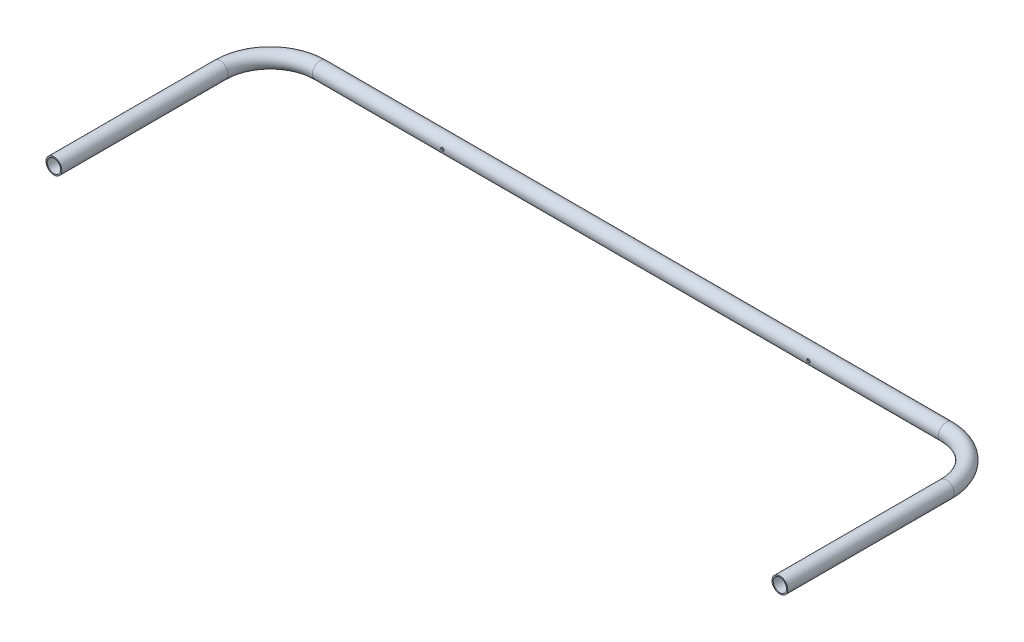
ISO-10303-21;
HEADER;
FILE_DESCRIPTION(('STEP AP214'),'2;1');
FILE_NAME('part.step','',(''),(''),'','','');
FILE_SCHEMA(('AUTOMOTIVE_DESIGN { 1 0 10303 214 1 1 1 1 }'));
ENDSEC;
DATA;
#1=APPLICATION_CONTEXT('core data for automotive mechanical design processes');
#2=APPLICATION_PROTOCOL_DEFINITION('international standard','automotive_design',2000,#1);
#3=PRODUCT_CONTEXT('',#1,'mechanical');
#4=PRODUCT('Part','Part','',(#3));
#5=PRODUCT_RELATED_PRODUCT_CATEGORY('part','',(#4));
#6=PRODUCT_DEFINITION_FORMATION('','',#4);
#7=PRODUCT_DEFINITION_CONTEXT('part definition',#1,'design');
#8=PRODUCT_DEFINITION('design','',#6,#7);
#9=PRODUCT_DEFINITION_SHAPE('','',#8);
#10=(LENGTH_UNIT() NAMED_UNIT(*) SI_UNIT(.MILLI.,.METRE.));
#11=(NAMED_UNIT(*) PLANE_ANGLE_UNIT() SI_UNIT($,.RADIAN.));
#12=(NAMED_UNIT(*) SI_UNIT($,.STERADIAN.) SOLID_ANGLE_UNIT());
#13=UNCERTAINTY_MEASURE_WITH_UNIT(LENGTH_MEASURE(1.E-05),#10,'distance_accuracy_value','');
#14=(GEOMETRIC_REPRESENTATION_CONTEXT(3) GLOBAL_UNCERTAINTY_ASSIGNED_CONTEXT((#13)) GLOBAL_UNIT_ASSIGNED_CONTEXT((#10,
#11,#12)) REPRESENTATION_CONTEXT('',''));
#15=CARTESIAN_POINT('',(0.,0.,0.));
#16=DIRECTION('',(0.,0.,1.));
#17=DIRECTION('',(1.,0.,0.));
#18=AXIS2_PLACEMENT_3D('',#15,#16,#17);
#19=CARTESIAN_POINT('',(955.675,0.,-660.4));
#20=DIRECTION('',(-1.,0.,0.));
#21=DIRECTION('',(0.,0.,1.));
#22=AXIS2_PLACEMENT_3D('',#19,#20,#21);
#23=CYLINDRICAL_SURFACE('',#22,20.447);
#24=CARTESIAN_POINT('',(-553.974,0.,-680.847));
#25=CARTESIAN_POINT('',(-553.97400830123,-0.267112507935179,-680.84699522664));
#26=CARTESIAN_POINT('',(-553.996251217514,-0.534321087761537,-680.841713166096));
#27=CARTESIAN_POINT('',(-554.084520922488,-1.06111147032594,-680.821152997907));
#28=CARTESIAN_POINT('',(-554.150575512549,-1.32068832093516,-680.805868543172));
#29=CARTESIAN_POINT('',(-554.324255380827,-1.82452913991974,-680.767000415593));
#30=CARTESIAN_POINT('',(-554.431833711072,-2.0688100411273,-680.743426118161));
#31=CARTESIAN_POINT('',(-554.685349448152,-2.53585307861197,-680.690504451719));
#32=CARTESIAN_POINT('',(-554.831287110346,-2.75861507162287,-680.661157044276));
#33=CARTESIAN_POINT('',(-555.160234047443,-3.18042297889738,-680.599281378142));
#34=CARTESIAN_POINT('',(-555.343818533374,-3.37901378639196,-680.566708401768));
#35=CARTESIAN_POINT('',(-555.741614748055,-3.74289076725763,-680.502358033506));
#36=CARTESIAN_POINT('',(-555.955829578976,-3.90817356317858,-680.470580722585));
#37=CARTESIAN_POINT('',(-556.41226138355,-4.20282167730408,-680.410973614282));
#38=CARTESIAN_POINT('',(-556.654807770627,-4.33168928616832,-680.383200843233));
#39=CARTESIAN_POINT('',(-557.15888024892,-4.54665209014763,-680.335394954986));
#40=CARTESIAN_POINT('',(-557.420403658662,-4.63275331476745,-680.315360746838));
#41=CARTESIAN_POINT('',(-557.950032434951,-4.75820900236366,-680.285758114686));
#42=CARTESIAN_POINT('',(-558.217934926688,-4.79837609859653,-680.276008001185));
#43=CARTESIAN_POINT('',(-558.756839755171,-4.8333525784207,-680.267532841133));
#44=CARTESIAN_POINT('',(-559.027841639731,-4.82816849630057,-680.268806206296));
#45=CARTESIAN_POINT('',(-559.559112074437,-4.77324071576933,-680.282070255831));
#46=CARTESIAN_POINT('',(-559.819486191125,-4.72445393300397,-680.293830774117));
#47=CARTESIAN_POINT('',(-560.328246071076,-4.58522728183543,-680.326378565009));
#48=CARTESIAN_POINT('',(-560.576631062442,-4.49478473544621,-680.347166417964));
#49=CARTESIAN_POINT('',(-561.056985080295,-4.27396949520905,-680.395645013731));
#50=CARTESIAN_POINT('',(-561.28878365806,-4.1432400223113,-680.423397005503));
#51=CARTESIAN_POINT('',(-561.727502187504,-3.8458119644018,-680.48264099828));
#52=CARTESIAN_POINT('',(-561.934418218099,-3.67910772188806,-680.514133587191));
#53=CARTESIAN_POINT('',(-562.322993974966,-3.30945516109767,-680.578288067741));
#54=CARTESIAN_POINT('',(-562.503882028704,-3.10569638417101,-680.610959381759));
#55=CARTESIAN_POINT('',(-562.829057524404,-2.67035329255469,-680.67306816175));
#56=CARTESIAN_POINT('',(-562.973344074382,-2.43876829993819,-680.702505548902));
#57=CARTESIAN_POINT('',(-563.221460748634,-1.95331941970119,-680.754951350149));
#58=CARTESIAN_POINT('',(-563.325176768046,-1.69939512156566,-680.777941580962));
#59=CARTESIAN_POINT('',(-563.488244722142,-1.17705554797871,-680.81476938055));
#60=CARTESIAN_POINT('',(-563.547604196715,-0.908642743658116,-680.828608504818));
#61=CARTESIAN_POINT('',(-563.619121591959,-0.371552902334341,-680.845348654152));
#62=CARTESIAN_POINT('',(-563.632331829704,-0.103023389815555,-680.848493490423));
#63=CARTESIAN_POINT('',(-563.614046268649,0.43240703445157,-680.844179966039));
#64=CARTESIAN_POINT('',(-563.582554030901,0.699308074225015,-680.836722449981));
#65=CARTESIAN_POINT('',(-563.476627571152,1.22032705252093,-680.812197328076));
#66=CARTESIAN_POINT('',(-563.402757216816,1.47456610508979,-680.795255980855));
#67=CARTESIAN_POINT('',(-563.214807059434,1.96703795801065,-680.753665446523));
#68=CARTESIAN_POINT('',(-563.100723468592,2.2052692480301,-680.729015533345));
#69=CARTESIAN_POINT('',(-562.833475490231,2.66322640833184,-680.674149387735));
#70=CARTESIAN_POINT('',(-562.679708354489,2.88259028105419,-680.643849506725));
#71=CARTESIAN_POINT('',(-562.338239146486,3.29277682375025,-680.581193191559));
#72=CARTESIAN_POINT('',(-562.150531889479,3.48359512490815,-680.548836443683));
#73=CARTESIAN_POINT('',(-561.741649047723,3.83553022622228,-680.484851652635));
#74=CARTESIAN_POINT('',(-561.519835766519,3.99591291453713,-680.453254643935));
#75=CARTESIAN_POINT('',(-561.05181234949,4.27716505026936,-680.395158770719));
#76=CARTESIAN_POINT('',(-560.805603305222,4.39803626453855,-680.36865967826));
#77=CARTESIAN_POINT('',(-560.297121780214,4.595963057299,-680.32403654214));
#78=CARTESIAN_POINT('',(-560.034953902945,4.67327575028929,-680.305863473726));
#79=CARTESIAN_POINT('',(-559.500854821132,4.78260858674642,-680.279881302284));
#80=CARTESIAN_POINT('',(-559.228925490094,4.81463737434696,-680.272070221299));
#81=CARTESIAN_POINT('',(-558.690459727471,4.83207941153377,-680.267835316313));
#82=CARTESIAN_POINT('',(-558.423962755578,4.81866136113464,-680.271125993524));
#83=CARTESIAN_POINT('',(-557.897144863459,4.74823668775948,-680.288070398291));
#84=CARTESIAN_POINT('',(-557.636823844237,4.69123076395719,-680.30172395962));
#85=CARTESIAN_POINT('',(-557.130859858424,4.53585381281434,-680.337705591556));
#86=CARTESIAN_POINT('',(-556.885153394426,4.437679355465,-680.359992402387));
#87=CARTESIAN_POINT('',(-556.413534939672,4.20291217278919,-680.410739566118));
#88=CARTESIAN_POINT('',(-556.18762539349,4.06631471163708,-680.439200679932));
#89=CARTESIAN_POINT('',(-555.756312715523,3.75481727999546,-680.499921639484));
#90=CARTESIAN_POINT('',(-555.551512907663,3.57909605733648,-680.532254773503));
#91=CARTESIAN_POINT('',(-555.173926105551,3.19596964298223,-680.596614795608));
#92=CARTESIAN_POINT('',(-555.001146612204,2.98855704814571,-680.628641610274));
#93=CARTESIAN_POINT('',(-554.689887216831,2.54401702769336,-680.689377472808));
#94=CARTESIAN_POINT('',(-554.551986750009,2.30647517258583,-680.718026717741));
#95=CARTESIAN_POINT('',(-554.318293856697,1.81093948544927,-680.768164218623));
#96=CARTESIAN_POINT('',(-554.222468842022,1.55296166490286,-680.789658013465));
#97=CARTESIAN_POINT('',(-554.091206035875,1.07924422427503,-680.819577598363));
#98=CARTESIAN_POINT('',(-554.047343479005,0.865912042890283,-680.829793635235));
#99=CARTESIAN_POINT('',(-553.988737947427,0.435074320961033,-680.843506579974));
#100=CARTESIAN_POINT('',(-553.973993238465,0.217569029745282,-680.847003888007));
#101=CARTESIAN_POINT('',(-553.974,0.,-680.847));
#102=B_SPLINE_CURVE_WITH_KNOTS('',3,(#24,#25,#26,#27,#28,#29,#30,#31,#32,#33,#34,#35,#36,#37,
#38,#39,#40,#41,#42,#43,#44,#45,#46,#47,#48,#49,#50,#51,#52,#53,#54,#55,#56,#57,#58,#59,#60,#61,
#62,#63,#64,#65,#66,#67,#68,#69,#70,#71,#72,#73,#74,#75,#76,#77,#78,#79,#80,#81,#82,#83,#84,#85,
#86,#87,#88,#89,#90,#91,#92,#93,#94,#95,#96,#97,#98,#99,#100,#101),.UNSPECIFIED.,.T.,.F.,(4,2,2,
2,2,2,2,2,2,2,2,2,2,2,2,2,2,2,2,2,2,2,2,2,2,2,2,2,2,2,2,2,2,2,2,2,2,2,4),(0.,0.800540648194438,
1.6015897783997,2.4017358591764,3.20188726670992,4.01532210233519,4.82883937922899,
5.65299000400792,6.47702440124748,7.28624339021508,8.09534578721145,8.88711594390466,
9.67893700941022,10.4779823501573,11.2771534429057,12.0965490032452,12.9159645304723,
13.7376683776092,14.559232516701,15.3619361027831,16.1645757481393,16.9567755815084,
17.7490500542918,18.5541499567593,19.3593729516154,20.1820636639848,21.0047175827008,
21.8224633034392,22.6400529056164,23.4367788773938,24.2334920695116,25.0264436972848,
25.8194931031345,26.6310941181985,27.4428850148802,28.2673871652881,29.0912495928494,
29.7433464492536,30.3954044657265),.UNSPECIFIED.);
#103=CARTESIAN_POINT('',(-553.974,0.,-680.847));
#104=VERTEX_POINT('',#103);
#105=EDGE_CURVE('E84',#104,#104,#102,.T.);
#106=ORIENTED_EDGE('',*,*,#105,.T.);
#107=EDGE_LOOP('',(#106));
#108=FACE_BOUND('',#107,.T.);
#109=CARTESIAN_POINT('',(563.626,0.,-680.847));
#110=CARTESIAN_POINT('',(563.62599169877,-0.267112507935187,-680.84699522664));
#111=CARTESIAN_POINT('',(563.603748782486,-0.534321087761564,-680.841713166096));
#112=CARTESIAN_POINT('',(563.515479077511,-1.06111147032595,-680.821152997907));
#113=CARTESIAN_POINT('',(563.449424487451,-1.32068832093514,-680.805868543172));
#114=CARTESIAN_POINT('',(563.275744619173,-1.82452913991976,-680.767000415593));
#115=CARTESIAN_POINT('',(563.168166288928,-2.0688100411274,-680.743426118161));
#116=CARTESIAN_POINT('',(562.914650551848,-2.53585307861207,-680.690504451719));
#117=CARTESIAN_POINT('',(562.768712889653,-2.75861507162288,-680.661157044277));
#118=CARTESIAN_POINT('',(562.439765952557,-3.18042297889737,-680.599281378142));
#119=CARTESIAN_POINT('',(562.256181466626,-3.37901378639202,-680.566708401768));
#120=CARTESIAN_POINT('',(561.858385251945,-3.7428907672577,-680.502358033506));
#121=CARTESIAN_POINT('',(561.644170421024,-3.90817356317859,-680.470580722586));
#122=CARTESIAN_POINT('',(561.187738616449,-4.2028216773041,-680.410973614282));
#123=CARTESIAN_POINT('',(560.945192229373,-4.3316892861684,-680.383200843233));
#124=CARTESIAN_POINT('',(560.441119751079,-4.5466520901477,-680.335394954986));
#125=CARTESIAN_POINT('',(560.179596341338,-4.63275331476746,-680.315360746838));
#126=CARTESIAN_POINT('',(559.649967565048,-4.75820900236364,-680.285758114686));
#127=CARTESIAN_POINT('',(559.382065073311,-4.79837609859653,-680.276008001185));
#128=CARTESIAN_POINT('',(558.843160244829,-4.83335257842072,-680.267532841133));
#129=CARTESIAN_POINT('',(558.572158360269,-4.82816849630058,-680.268806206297));
#130=CARTESIAN_POINT('',(558.040887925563,-4.77324071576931,-680.282070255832));
#131=CARTESIAN_POINT('',(557.780513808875,-4.72445393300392,-680.293830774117));
#132=CARTESIAN_POINT('',(557.271753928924,-4.58522728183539,-680.326378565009));
#133=CARTESIAN_POINT('',(557.023368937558,-4.49478473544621,-680.347166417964));
#134=CARTESIAN_POINT('',(556.543014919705,-4.27396949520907,-680.395645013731));
#135=CARTESIAN_POINT('',(556.31121634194,-4.14324002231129,-680.423397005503));
#136=CARTESIAN_POINT('',(555.872497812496,-3.84581196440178,-680.48264099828));
#137=CARTESIAN_POINT('',(555.665581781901,-3.67910772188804,-680.514133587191));
#138=CARTESIAN_POINT('',(555.277006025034,-3.30945516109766,-680.578288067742));
#139=CARTESIAN_POINT('',(555.096117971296,-3.105696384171,-680.610959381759));
#140=CARTESIAN_POINT('',(554.770942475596,-2.67035329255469,-680.67306816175));
#141=CARTESIAN_POINT('',(554.626655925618,-2.4387682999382,-680.702505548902));
#142=CARTESIAN_POINT('',(554.378539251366,-1.95331941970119,-680.754951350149));
#143=CARTESIAN_POINT('',(554.274823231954,-1.69939512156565,-680.777941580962));
#144=CARTESIAN_POINT('',(554.111755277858,-1.17705554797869,-680.81476938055));
#145=CARTESIAN_POINT('',(554.052395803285,-0.908642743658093,-680.828608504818));
#146=CARTESIAN_POINT('',(553.980878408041,-0.371552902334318,-680.845348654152));
#147=CARTESIAN_POINT('',(553.967668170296,-0.103023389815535,-680.848493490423));
#148=CARTESIAN_POINT('',(553.985953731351,0.432407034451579,-680.844179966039));
#149=CARTESIAN_POINT('',(554.017445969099,0.699308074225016,-680.836722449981));
#150=CARTESIAN_POINT('',(554.123372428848,1.22032705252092,-680.812197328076));
#151=CARTESIAN_POINT('',(554.197242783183,1.47456610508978,-680.795255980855));
#152=CARTESIAN_POINT('',(554.385192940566,1.96703795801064,-680.753665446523));
#153=CARTESIAN_POINT('',(554.499276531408,2.20526924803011,-680.729015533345));
#154=CARTESIAN_POINT('',(554.766524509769,2.6632264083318,-680.674149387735));
#155=CARTESIAN_POINT('',(554.920291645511,2.8825902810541,-680.643849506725));
#156=CARTESIAN_POINT('',(555.261760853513,3.29277682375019,-680.581193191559));
#157=CARTESIAN_POINT('',(555.44946811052,3.48359512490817,-680.548836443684));
#158=CARTESIAN_POINT('',(555.858350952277,3.83553022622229,-680.484851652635));
#159=CARTESIAN_POINT('',(556.08016423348,3.99591291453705,-680.453254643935));
#160=CARTESIAN_POINT('',(556.54818765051,4.27716505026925,-680.395158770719));
#161=CARTESIAN_POINT('',(556.794396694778,4.39803626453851,-680.368659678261));
#162=CARTESIAN_POINT('',(557.302878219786,4.59596305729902,-680.32403654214));
#163=CARTESIAN_POINT('',(557.565046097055,4.6732757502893,-680.305863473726));
#164=CARTESIAN_POINT('',(558.099145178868,4.78260858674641,-680.279881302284));
#165=CARTESIAN_POINT('',(558.371074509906,4.81463737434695,-680.272070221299));
#166=CARTESIAN_POINT('',(558.909540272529,4.83207941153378,-680.267835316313));
#167=CARTESIAN_POINT('',(559.176037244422,4.81866136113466,-680.271125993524));
#168=CARTESIAN_POINT('',(559.70285513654,4.74823668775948,-680.288070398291));
#169=CARTESIAN_POINT('',(559.963176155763,4.69123076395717,-680.30172395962));
#170=CARTESIAN_POINT('',(560.469140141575,4.53585381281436,-680.337705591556));
#171=CARTESIAN_POINT('',(560.714846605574,4.43767935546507,-680.359992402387));
#172=CARTESIAN_POINT('',(561.186465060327,4.20291217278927,-680.410739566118));
#173=CARTESIAN_POINT('',(561.41237460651,4.06631471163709,-680.439200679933));
#174=CARTESIAN_POINT('',(561.843687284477,3.75481727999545,-680.499921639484));
#175=CARTESIAN_POINT('',(562.048487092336,3.57909605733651,-680.532254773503));
#176=CARTESIAN_POINT('',(562.426073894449,3.19596964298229,-680.596614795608));
#177=CARTESIAN_POINT('',(562.598853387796,2.98855704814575,-680.628641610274));
#178=CARTESIAN_POINT('',(562.910112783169,2.54401702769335,-680.689377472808));
#179=CARTESIAN_POINT('',(563.048013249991,2.30647517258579,-680.718026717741));
#180=CARTESIAN_POINT('',(563.281706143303,1.81093948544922,-680.768164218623));
#181=CARTESIAN_POINT('',(563.377531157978,1.55296166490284,-680.789658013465));
#182=CARTESIAN_POINT('',(563.508793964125,1.07924422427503,-680.819577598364));
#183=CARTESIAN_POINT('',(563.552656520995,0.86591204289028,-680.829793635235));
#184=CARTESIAN_POINT('',(563.611262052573,0.435074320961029,-680.843506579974));
#185=CARTESIAN_POINT('',(563.626006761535,0.217569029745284,-680.847003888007));
#186=CARTESIAN_POINT('',(563.626,0.,-680.847));
#187=B_SPLINE_CURVE_WITH_KNOTS('',3,(#109,#110,#111,#112,#113,#114,#115,#116,#117,#118,#119,
#120,#121,#122,#123,#124,#125,#126,#127,#128,#129,#130,#131,#132,#133,#134,#135,#136,#137,#138,
#139,#140,#141,#142,#143,#144,#145,#146,#147,#148,#149,#150,#151,#152,#153,#154,#155,#156,#157,
#158,#159,#160,#161,#162,#163,#164,#165,#166,#167,#168,#169,#170,#171,#172,#173,#174,#175,#176,
#177,#178,#179,#180,#181,#182,#183,#184,#185,#186),.UNSPECIFIED.,.T.,.F.,(4,2,2,2,2,2,2,2,2,2,2,
2,2,2,2,2,2,2,2,2,2,2,2,2,2,2,2,2,2,2,2,2,2,2,2,2,2,2,4),(0.,0.800540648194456,1.60158977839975,
2.40173585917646,3.20188726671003,4.01532210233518,4.82883937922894,5.65299000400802,
6.47702440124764,7.28624339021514,8.0953457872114,8.88711594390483,9.67893700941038,
10.4779823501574,11.2771534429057,12.0965490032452,12.9159645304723,13.7376683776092,
14.559232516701,15.3619361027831,16.1645757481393,16.9567755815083,17.7490500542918,
18.5541499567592,19.3593729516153,20.1820636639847,21.0047175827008,21.8224633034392,
22.6400529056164,23.4367788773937,24.2334920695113,25.0264436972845,25.8194931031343,
26.6310941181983,27.4428850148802,28.2673871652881,29.0912495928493,29.7433464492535,
30.3954044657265),.UNSPECIFIED.);
#188=CARTESIAN_POINT('',(563.626,0.,-680.847));
#189=VERTEX_POINT('',#188);
#190=EDGE_CURVE('E100',#189,#189,#187,.T.);
#191=ORIENTED_EDGE('',*,*,#190,.T.);
#192=EDGE_LOOP('',(#191));
#193=FACE_BOUND('',#192,.T.);
#194=CARTESIAN_POINT('',(955.675,0.,-660.4));
#195=DIRECTION('',(1.,0.,0.));
#196=DIRECTION('',(0.,0.,-1.));
#197=AXIS2_PLACEMENT_3D('',#194,#195,#196);
#198=CIRCLE('',#197,20.447);
#199=CARTESIAN_POINT('',(955.675,0.,-680.847));
#200=VERTEX_POINT('',#199);
#201=EDGE_CURVE('E128',#200,#200,#198,.T.);
#202=ORIENTED_EDGE('',*,*,#201,.T.);
#203=EDGE_LOOP('',(#202));
#204=FACE_BOUND('',#203,.T.);
#205=CARTESIAN_POINT('',(-955.675,0.,-660.4));
#206=DIRECTION('',(1.,0.,0.));
#207=DIRECTION('',(0.,0.,-1.));
#208=AXIS2_PLACEMENT_3D('',#205,#206,#207);
#209=CIRCLE('',#208,20.447);
#210=CARTESIAN_POINT('',(-955.675,0.,-680.847));
#211=VERTEX_POINT('',#210);
#212=EDGE_CURVE('E110',#211,#211,#209,.T.);
#213=ORIENTED_EDGE('',*,*,#212,.F.);
#214=EDGE_LOOP('',(#213));
#215=FACE_BOUND('',#214,.T.);
#216=CARTESIAN_POINT('',(563.626,0.,-639.953));
#217=CARTESIAN_POINT('',(563.62599169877,0.267112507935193,-639.95300477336));
#218=CARTESIAN_POINT('',(563.603748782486,0.534321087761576,-639.958286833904));
#219=CARTESIAN_POINT('',(563.515479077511,1.06111147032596,-639.978847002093));
#220=CARTESIAN_POINT('',(563.449424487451,1.32068832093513,-639.994131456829));
#221=CARTESIAN_POINT('',(563.275744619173,1.82452913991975,-640.032999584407));
#222=CARTESIAN_POINT('',(563.168166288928,2.06881004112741,-640.056573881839));
#223=CARTESIAN_POINT('',(562.914650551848,2.53585307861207,-640.109495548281));
#224=CARTESIAN_POINT('',(562.768712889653,2.75861507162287,-640.138842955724));
#225=CARTESIAN_POINT('',(562.439765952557,3.18042297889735,-640.200718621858));
#226=CARTESIAN_POINT('',(562.256181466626,3.37901378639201,-640.233291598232));
#227=CARTESIAN_POINT('',(561.858385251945,3.7428907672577,-640.297641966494));
#228=CARTESIAN_POINT('',(561.644170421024,3.90817356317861,-640.329419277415));
#229=CARTESIAN_POINT('',(561.187738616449,4.20282167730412,-640.389026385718));
#230=CARTESIAN_POINT('',(560.945192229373,4.3316892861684,-640.416799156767));
#231=CARTESIAN_POINT('',(560.441119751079,4.54665209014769,-640.464605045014));
#232=CARTESIAN_POINT('',(560.179596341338,4.63275331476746,-640.484639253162));
#233=CARTESIAN_POINT('',(559.649967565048,4.75820900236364,-640.514241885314));
#234=CARTESIAN_POINT('',(559.382065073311,4.79837609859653,-640.523991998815));
#235=CARTESIAN_POINT('',(558.843160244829,4.83335257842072,-640.532467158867));
#236=CARTESIAN_POINT('',(558.572158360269,4.82816849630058,-640.531193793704));
#237=CARTESIAN_POINT('',(558.040887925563,4.77324071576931,-640.517929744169));
#238=CARTESIAN_POINT('',(557.780513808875,4.72445393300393,-640.506169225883));
#239=CARTESIAN_POINT('',(557.271753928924,4.58522728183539,-640.473621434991));
#240=CARTESIAN_POINT('',(557.023368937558,4.49478473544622,-640.452833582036));
#241=CARTESIAN_POINT('',(556.543014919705,4.27396949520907,-640.404354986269));
#242=CARTESIAN_POINT('',(556.31121634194,4.14324002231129,-640.376602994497));
#243=CARTESIAN_POINT('',(555.872497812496,3.84581196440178,-640.31735900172));
#244=CARTESIAN_POINT('',(555.665581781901,3.67910772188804,-640.285866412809));
#245=CARTESIAN_POINT('',(555.277006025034,3.30945516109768,-640.221711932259));
#246=CARTESIAN_POINT('',(555.096117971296,3.10569638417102,-640.189040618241));
#247=CARTESIAN_POINT('',(554.770942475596,2.67035329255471,-640.12693183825));
#248=CARTESIAN_POINT('',(554.626655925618,2.4387682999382,-640.097494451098));
#249=CARTESIAN_POINT('',(554.378539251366,1.95331941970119,-640.045048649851));
#250=CARTESIAN_POINT('',(554.274823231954,1.69939512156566,-640.022058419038));
#251=CARTESIAN_POINT('',(554.111755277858,1.1770555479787,-639.98523061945));
#252=CARTESIAN_POINT('',(554.052395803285,0.908642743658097,-639.971391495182));
#253=CARTESIAN_POINT('',(553.980878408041,0.371552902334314,-639.954651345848));
#254=CARTESIAN_POINT('',(553.967668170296,0.103023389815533,-639.951506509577));
#255=CARTESIAN_POINT('',(553.985953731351,-0.43240703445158,-639.955820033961));
#256=CARTESIAN_POINT('',(554.017445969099,-0.699308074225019,-639.963277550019));
#257=CARTESIAN_POINT('',(554.123372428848,-1.22032705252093,-639.987802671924));
#258=CARTESIAN_POINT('',(554.197242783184,-1.47456610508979,-640.004744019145));
#259=CARTESIAN_POINT('',(554.385192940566,-1.96703795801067,-640.046334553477));
#260=CARTESIAN_POINT('',(554.499276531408,-2.20526924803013,-640.070984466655));
#261=CARTESIAN_POINT('',(554.766524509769,-2.66322640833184,-640.125850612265));
#262=CARTESIAN_POINT('',(554.920291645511,-2.88259028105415,-640.156150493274));
#263=CARTESIAN_POINT('',(555.261760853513,-3.29277682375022,-640.21880680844));
#264=CARTESIAN_POINT('',(555.44946811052,-3.48359512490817,-640.251163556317));
#265=CARTESIAN_POINT('',(555.858350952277,-3.83553022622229,-640.315148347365));
#266=CARTESIAN_POINT('',(556.08016423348,-3.99591291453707,-640.346745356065));
#267=CARTESIAN_POINT('',(556.54818765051,-4.27716505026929,-640.404841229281));
#268=CARTESIAN_POINT('',(556.794396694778,-4.39803626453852,-640.43134032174));
#269=CARTESIAN_POINT('',(557.302878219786,-4.59596305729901,-640.47596345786));
#270=CARTESIAN_POINT('',(557.565046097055,-4.6732757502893,-640.494136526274));
#271=CARTESIAN_POINT('',(558.099145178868,-4.78260858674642,-640.520118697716));
#272=CARTESIAN_POINT('',(558.371074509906,-4.81463737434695,-640.527929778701));
#273=CARTESIAN_POINT('',(558.909540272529,-4.83207941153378,-640.532164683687));
#274=CARTESIAN_POINT('',(559.176037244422,-4.81866136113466,-640.528874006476));
#275=CARTESIAN_POINT('',(559.70285513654,-4.74823668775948,-640.511929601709));
#276=CARTESIAN_POINT('',(559.963176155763,-4.69123076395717,-640.49827604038));
#277=CARTESIAN_POINT('',(560.469140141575,-4.53585381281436,-640.462294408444));
#278=CARTESIAN_POINT('',(560.714846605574,-4.43767935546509,-640.440007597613));
#279=CARTESIAN_POINT('',(561.186465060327,-4.20291217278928,-640.389260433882));
#280=CARTESIAN_POINT('',(561.41237460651,-4.06631471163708,-640.360799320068));
#281=CARTESIAN_POINT('',(561.843687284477,-3.75481727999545,-640.300078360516));
#282=CARTESIAN_POINT('',(562.048487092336,-3.57909605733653,-640.267745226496));
#283=CARTESIAN_POINT('',(562.426073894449,-3.19596964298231,-640.203385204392));
#284=CARTESIAN_POINT('',(562.598853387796,-2.98855704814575,-640.171358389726));
#285=CARTESIAN_POINT('',(562.910112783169,-2.54401702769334,-640.110622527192));
#286=CARTESIAN_POINT('',(563.048013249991,-2.30647517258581,-640.081973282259));
#287=CARTESIAN_POINT('',(563.281706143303,-1.81093948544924,-640.031835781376));
#288=CARTESIAN_POINT('',(563.377531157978,-1.55296166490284,-640.010341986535));
#289=CARTESIAN_POINT('',(563.508793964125,-1.07924422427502,-639.980422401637));
#290=CARTESIAN_POINT('',(563.552656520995,-0.865912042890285,-639.970206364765));
#291=CARTESIAN_POINT('',(563.611262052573,-0.435074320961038,-639.956493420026));
#292=CARTESIAN_POINT('',(563.626006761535,-0.217569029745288,-639.952996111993));
#293=CARTESIAN_POINT('',(563.626,0.,-639.953));
#294=B_SPLINE_CURVE_WITH_KNOTS('',3,(#216,#217,#218,#219,#220,#221,#222,#223,#224,#225,#226,
#227,#228,#229,#230,#231,#232,#233,#234,#235,#236,#237,#238,#239,#240,#241,#242,#243,#244,#245,
#246,#247,#248,#249,#250,#251,#252,#253,#254,#255,#256,#257,#258,#259,#260,#261,#262,#263,#264,
#265,#266,#267,#268,#269,#270,#271,#272,#273,#274,#275,#276,#277,#278,#279,#280,#281,#282,#283,
#284,#285,#286,#287,#288,#289,#290,#291,#292,#293),.UNSPECIFIED.,.T.,.F.,(4,2,2,2,2,2,2,2,2,2,2,
2,2,2,2,2,2,2,2,2,2,2,2,2,2,2,2,2,2,2,2,2,2,2,2,2,2,2,4),(0.,0.800540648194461,1.60158977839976,
2.40173585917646,3.20188726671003,4.01532210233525,4.82883937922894,5.6529900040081,
6.47702440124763,7.28624339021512,8.09534578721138,8.88711594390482,9.67893700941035,
10.4779823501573,11.2771534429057,12.0965490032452,12.9159645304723,13.7376683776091,
14.5592325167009,15.361936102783,16.1645757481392,16.9567755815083,17.7490500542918,
18.5541499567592,19.3593729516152,20.1820636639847,21.0047175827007,21.8224633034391,
22.6400529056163,23.4367788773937,24.2334920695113,25.0264436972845,25.8194931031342,
26.6310941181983,27.4428850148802,28.2673871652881,29.0912495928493,29.7433464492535,
30.3954044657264),.UNSPECIFIED.);
#295=CARTESIAN_POINT('',(563.626,0.,-639.953));
#296=VERTEX_POINT('',#295);
#297=EDGE_CURVE('E105',#296,#296,#294,.T.);
#298=ORIENTED_EDGE('',*,*,#297,.T.);
#299=EDGE_LOOP('',(#298));
#300=FACE_BOUND('',#299,.T.);
#301=CARTESIAN_POINT('',(-553.974,0.,-639.953));
#302=CARTESIAN_POINT('',(-553.97400830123,0.267112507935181,-639.95300477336));
#303=CARTESIAN_POINT('',(-553.996251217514,0.534321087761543,-639.958286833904));
#304=CARTESIAN_POINT('',(-554.084520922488,1.06111147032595,-639.978847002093));
#305=CARTESIAN_POINT('',(-554.150575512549,1.32068832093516,-639.994131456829));
#306=CARTESIAN_POINT('',(-554.324255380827,1.82452913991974,-640.032999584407));
#307=CARTESIAN_POINT('',(-554.431833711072,2.06881004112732,-640.056573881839));
#308=CARTESIAN_POINT('',(-554.685349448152,2.53585307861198,-640.109495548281));
#309=CARTESIAN_POINT('',(-554.831287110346,2.75861507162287,-640.138842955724));
#310=CARTESIAN_POINT('',(-555.160234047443,3.18042297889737,-640.200718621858));
#311=CARTESIAN_POINT('',(-555.343818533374,3.37901378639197,-640.233291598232));
#312=CARTESIAN_POINT('',(-555.741614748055,3.74289076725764,-640.297641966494));
#313=CARTESIAN_POINT('',(-555.955829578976,3.90817356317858,-640.329419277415));
#314=CARTESIAN_POINT('',(-556.41226138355,4.20282167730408,-640.389026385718));
#315=CARTESIAN_POINT('',(-556.654807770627,4.33168928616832,-640.416799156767));
#316=CARTESIAN_POINT('',(-557.15888024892,4.54665209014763,-640.464605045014));
#317=CARTESIAN_POINT('',(-557.420403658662,4.63275331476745,-640.484639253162));
#318=CARTESIAN_POINT('',(-557.950032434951,4.75820900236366,-640.514241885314));
#319=CARTESIAN_POINT('',(-558.217934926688,4.79837609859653,-640.523991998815));
#320=CARTESIAN_POINT('',(-558.756839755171,4.8333525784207,-640.532467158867));
#321=CARTESIAN_POINT('',(-559.027841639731,4.82816849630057,-640.531193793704));
#322=CARTESIAN_POINT('',(-559.559112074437,4.77324071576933,-640.517929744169));
#323=CARTESIAN_POINT('',(-559.819486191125,4.72445393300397,-640.506169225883));
#324=CARTESIAN_POINT('',(-560.328246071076,4.58522728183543,-640.473621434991));
#325=CARTESIAN_POINT('',(-560.576631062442,4.49478473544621,-640.452833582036));
#326=CARTESIAN_POINT('',(-561.056985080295,4.27396949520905,-640.404354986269));
#327=CARTESIAN_POINT('',(-561.28878365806,4.1432400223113,-640.376602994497));
#328=CARTESIAN_POINT('',(-561.727502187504,3.84581196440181,-640.31735900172));
#329=CARTESIAN_POINT('',(-561.934418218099,3.67910772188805,-640.285866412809));
#330=CARTESIAN_POINT('',(-562.322993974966,3.30945516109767,-640.221711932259));
#331=CARTESIAN_POINT('',(-562.503882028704,3.10569638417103,-640.189040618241));
#332=CARTESIAN_POINT('',(-562.829057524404,2.67035329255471,-640.12693183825));
#333=CARTESIAN_POINT('',(-562.973344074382,2.4387682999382,-640.097494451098));
#334=CARTESIAN_POINT('',(-563.221460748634,1.95331941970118,-640.045048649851));
#335=CARTESIAN_POINT('',(-563.325176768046,1.69939512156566,-640.022058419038));
#336=CARTESIAN_POINT('',(-563.488244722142,1.1770555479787,-639.98523061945));
#337=CARTESIAN_POINT('',(-563.547604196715,0.908642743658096,-639.971391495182));
#338=CARTESIAN_POINT('',(-563.619121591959,0.371552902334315,-639.954651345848));
#339=CARTESIAN_POINT('',(-563.632331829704,0.103023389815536,-639.951506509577));
#340=CARTESIAN_POINT('',(-563.614046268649,-0.432407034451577,-639.955820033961));
#341=CARTESIAN_POINT('',(-563.582554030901,-0.699308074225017,-639.963277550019));
#342=CARTESIAN_POINT('',(-563.476627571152,-1.22032705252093,-639.987802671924));
#343=CARTESIAN_POINT('',(-563.402757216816,-1.4745661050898,-640.004744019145));
#344=CARTESIAN_POINT('',(-563.214807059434,-1.96703795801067,-640.046334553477));
#345=CARTESIAN_POINT('',(-563.100723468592,-2.20526924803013,-640.070984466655));
#346=CARTESIAN_POINT('',(-562.833475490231,-2.66322640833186,-640.125850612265));
#347=CARTESIAN_POINT('',(-562.679708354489,-2.88259028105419,-640.156150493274));
#348=CARTESIAN_POINT('',(-562.338239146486,-3.29277682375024,-640.21880680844));
#349=CARTESIAN_POINT('',(-562.150531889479,-3.48359512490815,-640.251163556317));
#350=CARTESIAN_POINT('',(-561.741649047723,-3.83553022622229,-640.315148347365));
#351=CARTESIAN_POINT('',(-561.519835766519,-3.99591291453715,-640.346745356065));
#352=CARTESIAN_POINT('',(-561.05181234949,-4.27716505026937,-640.404841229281));
#353=CARTESIAN_POINT('',(-560.805603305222,-4.39803626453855,-640.43134032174));
#354=CARTESIAN_POINT('',(-560.297121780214,-4.595963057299,-640.47596345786));
#355=CARTESIAN_POINT('',(-560.034953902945,-4.67327575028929,-640.494136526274));
#356=CARTESIAN_POINT('',(-559.500854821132,-4.78260858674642,-640.520118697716));
#357=CARTESIAN_POINT('',(-559.228925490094,-4.81463737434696,-640.527929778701));
#358=CARTESIAN_POINT('',(-558.690459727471,-4.83207941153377,-640.532164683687));
#359=CARTESIAN_POINT('',(-558.423962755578,-4.81866136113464,-640.528874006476));
#360=CARTESIAN_POINT('',(-557.897144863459,-4.74823668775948,-640.511929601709));
#361=CARTESIAN_POINT('',(-557.636823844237,-4.69123076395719,-640.49827604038));
#362=CARTESIAN_POINT('',(-557.130859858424,-4.53585381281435,-640.462294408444));
#363=CARTESIAN_POINT('',(-556.885153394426,-4.437679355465,-640.440007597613));
#364=CARTESIAN_POINT('',(-556.413534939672,-4.2029121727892,-640.389260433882));
#365=CARTESIAN_POINT('',(-556.18762539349,-4.06631471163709,-640.360799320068));
#366=CARTESIAN_POINT('',(-555.756312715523,-3.75481727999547,-640.300078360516));
#367=CARTESIAN_POINT('',(-555.551512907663,-3.57909605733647,-640.267745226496));
#368=CARTESIAN_POINT('',(-555.173926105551,-3.19596964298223,-640.203385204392));
#369=CARTESIAN_POINT('',(-555.001146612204,-2.98855704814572,-640.171358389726));
#370=CARTESIAN_POINT('',(-554.689887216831,-2.54401702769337,-640.110622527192));
#371=CARTESIAN_POINT('',(-554.551986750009,-2.30647517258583,-640.081973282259));
#372=CARTESIAN_POINT('',(-554.318293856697,-1.81093948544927,-640.031835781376));
#373=CARTESIAN_POINT('',(-554.222468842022,-1.55296166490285,-640.010341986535));
#374=CARTESIAN_POINT('',(-554.091206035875,-1.07924422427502,-639.980422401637));
#375=CARTESIAN_POINT('',(-554.047343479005,-0.865912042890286,-639.970206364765));
#376=CARTESIAN_POINT('',(-553.988737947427,-0.435074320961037,-639.956493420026));
#377=CARTESIAN_POINT('',(-553.973993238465,-0.217569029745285,-639.952996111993));
#378=CARTESIAN_POINT('',(-553.974,0.,-639.953));
#379=B_SPLINE_CURVE_WITH_KNOTS('',3,(#301,#302,#303,#304,#305,#306,#307,#308,#309,#310,#311,
#312,#313,#314,#315,#316,#317,#318,#319,#320,#321,#322,#323,#324,#325,#326,#327,#328,#329,#330,
#331,#332,#333,#334,#335,#336,#337,#338,#339,#340,#341,#342,#343,#344,#345,#346,#347,#348,#349,
#350,#351,#352,#353,#354,#355,#356,#357,#358,#359,#360,#361,#362,#363,#364,#365,#366,#367,#368,
#369,#370,#371,#372,#373,#374,#375,#376,#377,#378),.UNSPECIFIED.,.T.,.F.,(4,2,2,2,2,2,2,2,2,2,2,
2,2,2,2,2,2,2,2,2,2,2,2,2,2,2,2,2,2,2,2,2,2,2,2,2,2,2,4),(0.,0.80054064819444,1.6015897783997,
2.40173585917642,3.20188726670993,4.01532210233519,4.828839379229,5.65299000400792,
6.47702440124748,7.28624339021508,8.09534578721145,8.88711594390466,9.67893700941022,
10.4779823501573,11.2771534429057,12.0965490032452,12.9159645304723,13.7376683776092,
14.559232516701,15.3619361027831,16.1645757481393,16.9567755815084,17.7490500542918,
18.5541499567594,19.3593729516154,20.1820636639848,21.0047175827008,21.8224633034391,
22.6400529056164,23.4367788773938,24.2334920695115,25.0264436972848,25.8194931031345,
26.6310941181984,27.4428850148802,28.2673871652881,29.0912495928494,29.7433464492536,
30.3954044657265),.UNSPECIFIED.);
#380=CARTESIAN_POINT('',(-553.974,0.,-639.953));
#381=VERTEX_POINT('',#380);
#382=EDGE_CURVE('E88',#381,#381,#379,.T.);
#383=ORIENTED_EDGE('',*,*,#382,.T.);
#384=EDGE_LOOP('',(#383));
#385=FACE_BOUND('',#384,.T.);
#386=ADVANCED_FACE('F41',(#108,#193,#204,#215,#300,#385),#23,.F.);
#387=CARTESIAN_POINT('',(955.675,0.,-660.4));
#388=DIRECTION('',(-1.,0.,0.));
#389=DIRECTION('',(0.,0.,1.));
#390=AXIS2_PLACEMENT_3D('',#387,#388,#389);
#391=CYLINDRICAL_SURFACE('',#390,24.1299999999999);
#392=CARTESIAN_POINT('',(-553.974,0.,-684.53));
#393=CARTESIAN_POINT('',(-553.974009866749,-0.268214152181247,-684.529995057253));
#394=CARTESIAN_POINT('',(-553.996435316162,-0.536553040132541,-684.525482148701));
#395=CARTESIAN_POINT('',(-554.085473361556,-1.06564598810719,-684.507914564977));
#396=CARTESIAN_POINT('',(-554.1521210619,-1.32639385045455,-684.494853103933));
#397=CARTESIAN_POINT('',(-554.327462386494,-1.83257845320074,-684.46164691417));
#398=CARTESIAN_POINT('',(-554.436115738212,-2.07802959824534,-684.441508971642));
#399=CARTESIAN_POINT('',(-554.692264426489,-2.54720135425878,-684.396339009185));
#400=CARTESIAN_POINT('',(-554.83975744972,-2.77092325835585,-684.371307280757));
#401=CARTESIAN_POINT('',(-555.171516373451,-3.1933327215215,-684.318725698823));
#402=CARTESIAN_POINT('',(-555.356206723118,-3.39168360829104,-684.291148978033));
#403=CARTESIAN_POINT('',(-555.756205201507,-3.75480538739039,-684.236780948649));
#404=CARTESIAN_POINT('',(-555.971515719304,-3.91957365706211,-684.209989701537));
#405=CARTESIAN_POINT('',(-556.429064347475,-4.21228604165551,-684.15996364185));
#406=CARTESIAN_POINT('',(-556.671529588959,-4.33988155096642,-684.136763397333));
#407=CARTESIAN_POINT('',(-557.174998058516,-4.55239314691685,-684.096927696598));
#408=CARTESIAN_POINT('',(-557.435999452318,-4.63731344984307,-684.080291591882));
#409=CARTESIAN_POINT('',(-557.965509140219,-4.76097109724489,-684.055739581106));
#410=CARTESIAN_POINT('',(-558.233874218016,-4.80029912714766,-684.047712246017));
#411=CARTESIAN_POINT('',(-558.773504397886,-4.83349056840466,-684.040951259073));
#412=CARTESIAN_POINT('',(-559.044769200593,-4.82735862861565,-684.042216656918));
#413=CARTESIAN_POINT('',(-559.57817699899,-4.77028176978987,-684.053796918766));
#414=CARTESIAN_POINT('',(-559.840395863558,-4.72001399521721,-684.063975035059));
#415=CARTESIAN_POINT('',(-560.352601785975,-4.57716123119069,-684.092018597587));
#416=CARTESIAN_POINT('',(-560.602588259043,-4.48457422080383,-684.109884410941));
#417=CARTESIAN_POINT('',(-561.085184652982,-4.25906460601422,-684.151430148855));
#418=CARTESIAN_POINT('',(-561.317665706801,-4.12587360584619,-684.175148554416));
#419=CARTESIAN_POINT('',(-561.757232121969,-3.82312619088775,-684.225702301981));
#420=CARTESIAN_POINT('',(-561.964314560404,-3.65356559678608,-684.252538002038));
#421=CARTESIAN_POINT('',(-562.351112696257,-3.27926668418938,-684.306895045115));
#422=CARTESIAN_POINT('',(-562.530269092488,-3.07395043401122,-684.334420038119));
#423=CARTESIAN_POINT('',(-562.85168686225,-2.63588892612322,-684.386612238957));
#424=CARTESIAN_POINT('',(-562.993947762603,-2.40314331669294,-684.411279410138));
#425=CARTESIAN_POINT('',(-563.237639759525,-1.9162086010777,-684.455037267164));
#426=CARTESIAN_POINT('',(-563.339006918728,-1.66198666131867,-684.474119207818));
#427=CARTESIAN_POINT('',(-563.49743764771,-1.13965496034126,-684.504490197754));
#428=CARTESIAN_POINT('',(-563.554506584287,-0.87154688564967,-684.515780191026));
#429=CARTESIAN_POINT('',(-563.621929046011,-0.333859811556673,-684.529163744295));
#430=CARTESIAN_POINT('',(-563.633047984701,-0.0643804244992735,-684.531407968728));
#431=CARTESIAN_POINT('',(-563.610316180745,0.472585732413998,-684.526865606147));
#432=CARTESIAN_POINT('',(-563.576467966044,0.740072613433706,-684.520079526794));
#433=CARTESIAN_POINT('',(-563.465398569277,1.26299151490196,-684.498333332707));
#434=CARTESIAN_POINT('',(-563.388570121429,1.51851030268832,-684.483447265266));
#435=CARTESIAN_POINT('',(-563.194150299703,2.01303862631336,-684.447164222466));
#436=CARTESIAN_POINT('',(-563.076555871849,2.25204692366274,-684.42576675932));
#437=CARTESIAN_POINT('',(-562.802286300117,2.70999770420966,-684.378459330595));
#438=CARTESIAN_POINT('',(-562.645150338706,2.92865871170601,-684.352497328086));
#439=CARTESIAN_POINT('',(-562.296875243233,3.33678336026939,-684.299063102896));
#440=CARTESIAN_POINT('',(-562.105732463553,3.52624386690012,-684.271590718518));
#441=CARTESIAN_POINT('',(-561.691385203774,3.87354349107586,-684.217724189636));
#442=CARTESIAN_POINT('',(-561.467736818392,4.03085715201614,-684.191352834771));
#443=CARTESIAN_POINT('',(-560.996740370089,4.30568683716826,-684.143157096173));
#444=CARTESIAN_POINT('',(-560.749393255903,4.42320445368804,-684.121332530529));
#445=CARTESIAN_POINT('',(-560.239266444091,4.61438878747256,-684.084885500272));
#446=CARTESIAN_POINT('',(-559.976574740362,4.68828284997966,-684.070225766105));
#447=CARTESIAN_POINT('',(-559.442179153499,4.79081195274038,-684.049689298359));
#448=CARTESIAN_POINT('',(-559.170476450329,4.8194528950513,-684.043811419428));
#449=CARTESIAN_POINT('',(-558.631047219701,4.83044431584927,-684.04156776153));
#450=CARTESIAN_POINT('',(-558.363337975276,4.81362511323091,-684.045031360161));
#451=CARTESIAN_POINT('',(-557.834647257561,4.73600621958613,-684.060699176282));
#452=CARTESIAN_POINT('',(-557.573665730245,4.67520688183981,-684.072903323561));
#453=CARTESIAN_POINT('',(-557.066367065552,4.51172397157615,-684.104600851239));
#454=CARTESIAN_POINT('',(-556.820015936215,4.40914221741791,-684.124076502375));
#455=CARTESIAN_POINT('',(-556.347891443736,4.16510171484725,-684.168132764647));
#456=CARTESIAN_POINT('',(-556.122119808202,4.02363970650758,-684.192713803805));
#457=CARTESIAN_POINT('',(-555.693428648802,3.70301834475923,-684.244733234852));
#458=CARTESIAN_POINT('',(-555.490962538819,3.52325936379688,-684.272213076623));
#459=CARTESIAN_POINT('',(-555.118793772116,3.13238464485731,-684.32663631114));
#460=CARTESIAN_POINT('',(-554.949098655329,2.92126171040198,-684.353579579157));
#461=CARTESIAN_POINT('',(-554.645612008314,2.47099707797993,-684.404226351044));
#462=CARTESIAN_POINT('',(-554.51221480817,2.23158527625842,-684.427892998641));
#463=CARTESIAN_POINT('',(-554.287756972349,1.73333685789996,-684.468957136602));
#464=CARTESIAN_POINT('',(-554.196658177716,1.47451799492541,-684.48636027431));
#465=CARTESIAN_POINT('',(-554.077025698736,1.01259850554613,-684.509555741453));
#466=CARTESIAN_POINT('',(-554.038459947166,0.812127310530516,-684.517177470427));
#467=CARTESIAN_POINT('',(-553.986943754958,0.407794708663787,-684.527401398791));
#468=CARTESIAN_POINT('',(-553.973992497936,0.203933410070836,-684.530003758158));
#469=CARTESIAN_POINT('',(-553.974,0.,-684.53));
#470=B_SPLINE_CURVE_WITH_KNOTS('',3,(#392,#393,#394,#395,#396,#397,#398,#399,#400,#401,#402,
#403,#404,#405,#406,#407,#408,#409,#410,#411,#412,#413,#414,#415,#416,#417,#418,#419,#420,#421,
#422,#423,#424,#425,#426,#427,#428,#429,#430,#431,#432,#433,#434,#435,#436,#437,#438,#439,#440,
#441,#442,#443,#444,#445,#446,#447,#448,#449,#450,#451,#452,#453,#454,#455,#456,#457,#458,#459,
#460,#461,#462,#463,#464,#465,#466,#467,#468,#469),.UNSPECIFIED.,.T.,.F.,(4,2,2,2,2,2,2,2,2,2,2,
2,2,2,2,2,2,2,2,2,2,2,2,2,2,2,2,2,2,2,2,2,2,2,2,2,2,2,4),(0.,0.803896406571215,1.60843172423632,
2.41219760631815,3.21591562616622,4.02938506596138,4.84291800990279,5.66385127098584,
6.48470340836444,7.29479749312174,8.10480873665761,8.90260554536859,9.70044045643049,
10.503667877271,11.3069876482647,12.1247580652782,12.9425389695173,13.7615935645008,
14.5805489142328,15.3858061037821,16.1910180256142,16.9889897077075,17.7870211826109,
18.5948224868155,19.4027104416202,20.2229007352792,21.0430582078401,21.8589027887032,
22.6746409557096,23.475581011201,24.2765146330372,25.075508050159,25.8745684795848,
26.687204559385,27.5000273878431,28.3213567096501,29.1419436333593,29.7531960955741,
30.3644290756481),.UNSPECIFIED.);
#471=CARTESIAN_POINT('',(-553.974,0.,-684.53));
#472=VERTEX_POINT('',#471);
#473=EDGE_CURVE('E12',#472,#472,#470,.T.);
#474=ORIENTED_EDGE('',*,*,#473,.F.);
#475=EDGE_LOOP('',(#474));
#476=FACE_BOUND('',#475,.T.);
#477=CARTESIAN_POINT('',(563.626,0.,-636.27));
#478=CARTESIAN_POINT('',(563.625990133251,0.26821415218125,-636.270004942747));
#479=CARTESIAN_POINT('',(563.603564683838,0.536553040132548,-636.274517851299));
#480=CARTESIAN_POINT('',(563.514526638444,1.06564598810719,-636.292085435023));
#481=CARTESIAN_POINT('',(563.4478789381,1.32639385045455,-636.305146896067));
#482=CARTESIAN_POINT('',(563.272537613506,1.83257845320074,-636.33835308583));
#483=CARTESIAN_POINT('',(563.163884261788,2.07802959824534,-636.358491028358));
#484=CARTESIAN_POINT('',(562.907735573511,2.54720135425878,-636.403660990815));
#485=CARTESIAN_POINT('',(562.760242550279,2.77092325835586,-636.428692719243));
#486=CARTESIAN_POINT('',(562.428483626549,3.19333272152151,-636.481274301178));
#487=CARTESIAN_POINT('',(562.243793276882,3.39168360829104,-636.508851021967));
#488=CARTESIAN_POINT('',(561.843794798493,3.75480538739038,-636.563219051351));
#489=CARTESIAN_POINT('',(561.628484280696,3.91957365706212,-636.590010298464));
#490=CARTESIAN_POINT('',(561.170935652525,4.21228604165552,-636.64003635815));
#491=CARTESIAN_POINT('',(560.928470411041,4.33988155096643,-636.663236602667));
#492=CARTESIAN_POINT('',(560.425001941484,4.55239314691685,-636.703072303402));
#493=CARTESIAN_POINT('',(560.164000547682,4.63731344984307,-636.719708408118));
#494=CARTESIAN_POINT('',(559.634490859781,4.76097109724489,-636.744260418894));
#495=CARTESIAN_POINT('',(559.366125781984,4.80029912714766,-636.752287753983));
#496=CARTESIAN_POINT('',(558.826495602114,4.83349056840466,-636.759048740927));
#497=CARTESIAN_POINT('',(558.555230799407,4.82735862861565,-636.757783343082));
#498=CARTESIAN_POINT('',(558.02182300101,4.77028176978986,-636.746203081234));
#499=CARTESIAN_POINT('',(557.759604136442,4.72001399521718,-636.736024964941));
#500=CARTESIAN_POINT('',(557.247398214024,4.57716123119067,-636.707981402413));
#501=CARTESIAN_POINT('',(556.997411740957,4.48457422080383,-636.690115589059));
#502=CARTESIAN_POINT('',(556.514815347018,4.2590646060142,-636.648569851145));
#503=CARTESIAN_POINT('',(556.282334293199,4.12587360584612,-636.624851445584));
#504=CARTESIAN_POINT('',(555.842767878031,3.82312619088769,-636.574297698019));
#505=CARTESIAN_POINT('',(555.635685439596,3.65356559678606,-636.547461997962));
#506=CARTESIAN_POINT('',(555.248887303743,3.2792666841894,-636.493104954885));
#507=CARTESIAN_POINT('',(555.069730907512,3.07395043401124,-636.465579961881));
#508=CARTESIAN_POINT('',(554.74831313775,2.63588892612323,-636.413387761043));
#509=CARTESIAN_POINT('',(554.606052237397,2.40314331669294,-636.388720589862));
#510=CARTESIAN_POINT('',(554.362360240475,1.9162086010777,-636.344962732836));
#511=CARTESIAN_POINT('',(554.260993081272,1.66198666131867,-636.325880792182));
#512=CARTESIAN_POINT('',(554.10256235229,1.13965496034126,-636.295509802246));
#513=CARTESIAN_POINT('',(554.045493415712,0.871546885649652,-636.284219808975));
#514=CARTESIAN_POINT('',(553.978070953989,0.333859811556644,-636.270836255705));
#515=CARTESIAN_POINT('',(553.966952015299,0.0643804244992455,-636.268592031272));
#516=CARTESIAN_POINT('',(553.989683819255,-0.472585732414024,-636.273134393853));
#517=CARTESIAN_POINT('',(554.023532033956,-0.740072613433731,-636.279920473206));
#518=CARTESIAN_POINT('',(554.134601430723,-1.262991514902,-636.301666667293));
#519=CARTESIAN_POINT('',(554.211429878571,-1.51851030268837,-636.316552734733));
#520=CARTESIAN_POINT('',(554.405849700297,-2.01303862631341,-636.352835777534));
#521=CARTESIAN_POINT('',(554.52344412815,-2.2520469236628,-636.37423324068));
#522=CARTESIAN_POINT('',(554.797713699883,-2.70999770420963,-636.421540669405));
#523=CARTESIAN_POINT('',(554.954849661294,-2.92865871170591,-636.447502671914));
#524=CARTESIAN_POINT('',(555.303124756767,-3.33678336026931,-636.500936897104));
#525=CARTESIAN_POINT('',(555.494267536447,-3.52624386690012,-636.528409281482));
#526=CARTESIAN_POINT('',(555.908614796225,-3.87354349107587,-636.582275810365));
#527=CARTESIAN_POINT('',(556.132263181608,-4.03085715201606,-636.608647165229));
#528=CARTESIAN_POINT('',(556.603259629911,-4.30568683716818,-636.656842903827));
#529=CARTESIAN_POINT('',(556.850606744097,-4.42320445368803,-636.678667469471));
#530=CARTESIAN_POINT('',(557.360733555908,-4.61438878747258,-636.715114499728));
#531=CARTESIAN_POINT('',(557.623425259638,-4.68828284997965,-636.729774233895));
#532=CARTESIAN_POINT('',(558.157820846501,-4.79081195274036,-636.750310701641));
#533=CARTESIAN_POINT('',(558.429523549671,-4.81945289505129,-636.756188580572));
#534=CARTESIAN_POINT('',(558.968952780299,-4.83044431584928,-636.75843223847));
#535=CARTESIAN_POINT('',(559.236662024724,-4.81362511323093,-636.754968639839));
#536=CARTESIAN_POINT('',(559.765352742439,-4.73600621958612,-636.739300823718));
#537=CARTESIAN_POINT('',(560.026334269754,-4.67520688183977,-636.727096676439));
#538=CARTESIAN_POINT('',(560.533632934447,-4.51172397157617,-636.695399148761));
#539=CARTESIAN_POINT('',(560.779984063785,-4.40914221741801,-636.675923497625));
#540=CARTESIAN_POINT('',(561.252108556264,-4.16510171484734,-636.631867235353));
#541=CARTESIAN_POINT('',(561.477880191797,-4.02363970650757,-636.607286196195));
#542=CARTESIAN_POINT('',(561.906571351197,-3.70301834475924,-636.555266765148));
#543=CARTESIAN_POINT('',(562.109037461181,-3.523259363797,-636.527786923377));
#544=CARTESIAN_POINT('',(562.481206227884,-3.13238464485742,-636.47336368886));
#545=CARTESIAN_POINT('',(562.650901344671,-2.92126171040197,-636.446420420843));
#546=CARTESIAN_POINT('',(562.954387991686,-2.47099707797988,-636.395773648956));
#547=CARTESIAN_POINT('',(563.087785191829,-2.23158527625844,-636.372107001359));
#548=CARTESIAN_POINT('',(563.312243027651,-1.73333685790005,-636.331042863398));
#549=CARTESIAN_POINT('',(563.403341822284,-1.47451799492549,-636.313639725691));
#550=CARTESIAN_POINT('',(563.522974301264,-1.0125985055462,-636.290444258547));
#551=CARTESIAN_POINT('',(563.561540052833,-0.812127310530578,-636.282822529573));
#552=CARTESIAN_POINT('',(563.613056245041,-0.407794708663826,-636.272598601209));
#553=CARTESIAN_POINT('',(563.626007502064,-0.203933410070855,-636.269996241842));
#554=CARTESIAN_POINT('',(563.626,0.,-636.27));
#555=B_SPLINE_CURVE_WITH_KNOTS('',3,(#477,#478,#479,#480,#481,#482,#483,#484,#485,#486,#487,
#488,#489,#490,#491,#492,#493,#494,#495,#496,#497,#498,#499,#500,#501,#502,#503,#504,#505,#506,
#507,#508,#509,#510,#511,#512,#513,#514,#515,#516,#517,#518,#519,#520,#521,#522,#523,#524,#525,
#526,#527,#528,#529,#530,#531,#532,#533,#534,#535,#536,#537,#538,#539,#540,#541,#542,#543,#544,
#545,#546,#547,#548,#549,#550,#551,#552,#553,#554),.UNSPECIFIED.,.T.,.F.,(4,2,2,2,2,2,2,2,2,2,2,
2,2,2,2,2,2,2,2,2,2,2,2,2,2,2,2,2,2,2,2,2,2,2,2,2,2,2,4),(0.,0.80389640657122,1.60843172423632,
2.41219760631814,3.21591562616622,4.02938506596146,4.84291800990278,5.66385127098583,
6.48470340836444,7.29479749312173,8.1048087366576,8.9026055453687,9.70044045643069,
10.503667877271,11.3069876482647,12.1247580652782,12.9425389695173,13.7615935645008,
14.5805489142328,15.3858061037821,16.1910180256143,16.9889897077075,17.7870211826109,
18.5948224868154,19.4027104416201,20.222900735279,21.04305820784,21.8589027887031,
22.6746409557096,23.4755810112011,24.276514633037,25.0755080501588,25.8745684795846,
26.6872045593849,27.500027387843,28.32135670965,29.1419436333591,29.753196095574,
30.3644290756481),.UNSPECIFIED.);
#556=CARTESIAN_POINT('',(563.626,0.,-636.27));
#557=VERTEX_POINT('',#556);
#558=EDGE_CURVE('E62',#557,#557,#555,.T.);
#559=ORIENTED_EDGE('',*,*,#558,.F.);
#560=EDGE_LOOP('',(#559));
#561=FACE_BOUND('',#560,.T.);
#562=CARTESIAN_POINT('',(955.675,0.,-660.4));
#563=DIRECTION('',(1.,0.,0.));
#564=DIRECTION('',(0.,0.,-1.));
#565=AXIS2_PLACEMENT_3D('',#562,#563,#564);
#566=CIRCLE('',#565,24.1299999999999);
#567=CARTESIAN_POINT('',(955.675,0.,-684.53));
#568=VERTEX_POINT('',#567);
#569=EDGE_CURVE('E131',#568,#568,#566,.T.);
#570=ORIENTED_EDGE('',*,*,#569,.F.);
#571=EDGE_LOOP('',(#570));
#572=FACE_BOUND('',#571,.T.);
#573=CARTESIAN_POINT('',(-955.675,0.,-660.4));
#574=DIRECTION('',(1.,0.,0.));
#575=DIRECTION('',(0.,0.,-1.));
#576=AXIS2_PLACEMENT_3D('',#573,#574,#575);
#577=CIRCLE('',#576,24.1299999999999);
#578=CARTESIAN_POINT('',(-955.675,0.,-684.53));
#579=VERTEX_POINT('',#578);
#580=EDGE_CURVE('E113',#579,#579,#577,.T.);
#581=ORIENTED_EDGE('',*,*,#580,.T.);
#582=EDGE_LOOP('',(#581));
#583=FACE_BOUND('',#582,.T.);
#584=CARTESIAN_POINT('',(563.626,0.,-684.53));
#585=CARTESIAN_POINT('',(563.625990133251,-0.268214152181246,-684.529995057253));
#586=CARTESIAN_POINT('',(563.603564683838,-0.536553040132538,-684.525482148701));
#587=CARTESIAN_POINT('',(563.514526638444,-1.06564598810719,-684.507914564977));
#588=CARTESIAN_POINT('',(563.4478789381,-1.32639385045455,-684.494853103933));
#589=CARTESIAN_POINT('',(563.272537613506,-1.83257845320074,-684.46164691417));
#590=CARTESIAN_POINT('',(563.163884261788,-2.07802959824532,-684.441508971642));
#591=CARTESIAN_POINT('',(562.907735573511,-2.54720135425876,-684.396339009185));
#592=CARTESIAN_POINT('',(562.760242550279,-2.77092325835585,-684.371307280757));
#593=CARTESIAN_POINT('',(562.428483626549,-3.19333272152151,-684.318725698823));
#594=CARTESIAN_POINT('',(562.243793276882,-3.39168360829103,-684.291148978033));
#595=CARTESIAN_POINT('',(561.843794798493,-3.75480538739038,-684.236780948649));
#596=CARTESIAN_POINT('',(561.628484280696,-3.91957365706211,-684.209989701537));
#597=CARTESIAN_POINT('',(561.170935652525,-4.21228604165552,-684.15996364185));
#598=CARTESIAN_POINT('',(560.928470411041,-4.33988155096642,-684.136763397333));
#599=CARTESIAN_POINT('',(560.425001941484,-4.55239314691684,-684.096927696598));
#600=CARTESIAN_POINT('',(560.164000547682,-4.63731344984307,-684.080291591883));
#601=CARTESIAN_POINT('',(559.634490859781,-4.76097109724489,-684.055739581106));
#602=CARTESIAN_POINT('',(559.366125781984,-4.80029912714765,-684.047712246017));
#603=CARTESIAN_POINT('',(558.826495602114,-4.83349056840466,-684.040951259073));
#604=CARTESIAN_POINT('',(558.555230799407,-4.82735862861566,-684.042216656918));
#605=CARTESIAN_POINT('',(558.02182300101,-4.77028176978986,-684.053796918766));
#606=CARTESIAN_POINT('',(557.759604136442,-4.72001399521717,-684.063975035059));
#607=CARTESIAN_POINT('',(557.247398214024,-4.57716123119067,-684.092018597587));
#608=CARTESIAN_POINT('',(556.997411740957,-4.48457422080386,-684.109884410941));
#609=CARTESIAN_POINT('',(556.514815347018,-4.25906460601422,-684.151430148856));
#610=CARTESIAN_POINT('',(556.282334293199,-4.12587360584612,-684.175148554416));
#611=CARTESIAN_POINT('',(555.842767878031,-3.82312619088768,-684.225702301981));
#612=CARTESIAN_POINT('',(555.635685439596,-3.65356559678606,-684.252538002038));
#613=CARTESIAN_POINT('',(555.248887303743,-3.2792666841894,-684.306895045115));
#614=CARTESIAN_POINT('',(555.069730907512,-3.07395043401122,-684.334420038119));
#615=CARTESIAN_POINT('',(554.74831313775,-2.63588892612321,-684.386612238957));
#616=CARTESIAN_POINT('',(554.606052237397,-2.40314331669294,-684.411279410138));
#617=CARTESIAN_POINT('',(554.362360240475,-1.91620860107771,-684.455037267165));
#618=CARTESIAN_POINT('',(554.260993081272,-1.66198666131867,-684.474119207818));
#619=CARTESIAN_POINT('',(554.10256235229,-1.13965496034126,-684.504490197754));
#620=CARTESIAN_POINT('',(554.045493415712,-0.871546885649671,-684.515780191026));
#621=CARTESIAN_POINT('',(553.978070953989,-0.333859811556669,-684.529163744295));
#622=CARTESIAN_POINT('',(553.966952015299,-0.064380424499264,-684.531407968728));
#623=CARTESIAN_POINT('',(553.989683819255,0.47258573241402,-684.526865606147));
#624=CARTESIAN_POINT('',(554.023532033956,0.740072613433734,-684.520079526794));
#625=CARTESIAN_POINT('',(554.134601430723,1.26299151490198,-684.498333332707));
#626=CARTESIAN_POINT('',(554.211429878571,1.51851030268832,-684.483447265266));
#627=CARTESIAN_POINT('',(554.405849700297,2.01303862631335,-684.447164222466));
#628=CARTESIAN_POINT('',(554.52344412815,2.25204692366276,-684.42576675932));
#629=CARTESIAN_POINT('',(554.797713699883,2.70999770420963,-684.378459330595));
#630=CARTESIAN_POINT('',(554.954849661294,2.92865871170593,-684.352497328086));
#631=CARTESIAN_POINT('',(555.303124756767,3.33678336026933,-684.299063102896));
#632=CARTESIAN_POINT('',(555.494267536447,3.52624386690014,-684.271590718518));
#633=CARTESIAN_POINT('',(555.908614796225,3.87354349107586,-684.217724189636));
#634=CARTESIAN_POINT('',(556.132263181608,4.03085715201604,-684.191352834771));
#635=CARTESIAN_POINT('',(556.603259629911,4.30568683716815,-684.143157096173));
#636=CARTESIAN_POINT('',(556.850606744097,4.42320445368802,-684.121332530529));
#637=CARTESIAN_POINT('',(557.360733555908,4.61438878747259,-684.084885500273));
#638=CARTESIAN_POINT('',(557.623425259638,4.68828284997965,-684.070225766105));
#639=CARTESIAN_POINT('',(558.157820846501,4.79081195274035,-684.049689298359));
#640=CARTESIAN_POINT('',(558.429523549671,4.81945289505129,-684.043811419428));
#641=CARTESIAN_POINT('',(558.968952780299,4.83044431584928,-684.04156776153));
#642=CARTESIAN_POINT('',(559.236662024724,4.81362511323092,-684.045031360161));
#643=CARTESIAN_POINT('',(559.765352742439,4.73600621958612,-684.060699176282));
#644=CARTESIAN_POINT('',(560.026334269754,4.67520688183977,-684.072903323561));
#645=CARTESIAN_POINT('',(560.533632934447,4.51172397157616,-684.10460085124));
#646=CARTESIAN_POINT('',(560.779984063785,4.40914221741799,-684.124076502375));
#647=CARTESIAN_POINT('',(561.252108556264,4.16510171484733,-684.168132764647));
#648=CARTESIAN_POINT('',(561.477880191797,4.02363970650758,-684.192713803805));
#649=CARTESIAN_POINT('',(561.906571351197,3.70301834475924,-684.244733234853));
#650=CARTESIAN_POINT('',(562.109037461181,3.52325936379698,-684.272213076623));
#651=CARTESIAN_POINT('',(562.481206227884,3.1323846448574,-684.32663631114));
#652=CARTESIAN_POINT('',(562.650901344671,2.92126171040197,-684.353579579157));
#653=CARTESIAN_POINT('',(562.954387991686,2.47099707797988,-684.404226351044));
#654=CARTESIAN_POINT('',(563.087785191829,2.23158527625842,-684.427892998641));
#655=CARTESIAN_POINT('',(563.312243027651,1.73333685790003,-684.468957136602));
#656=CARTESIAN_POINT('',(563.403341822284,1.47451799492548,-684.48636027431));
#657=CARTESIAN_POINT('',(563.522974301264,1.0125985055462,-684.509555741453));
#658=CARTESIAN_POINT('',(563.561540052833,0.812127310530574,-684.517177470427));
#659=CARTESIAN_POINT('',(563.613056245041,0.407794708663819,-684.527401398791));
#660=CARTESIAN_POINT('',(563.626007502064,0.203933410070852,-684.530003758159));
#661=CARTESIAN_POINT('',(563.626,0.,-684.53));
#662=B_SPLINE_CURVE_WITH_KNOTS('',3,(#584,#585,#586,#587,#588,#589,#590,#591,#592,#593,#594,
#595,#596,#597,#598,#599,#600,#601,#602,#603,#604,#605,#606,#607,#608,#609,#610,#611,#612,#613,
#614,#615,#616,#617,#618,#619,#620,#621,#622,#623,#624,#625,#626,#627,#628,#629,#630,#631,#632,
#633,#634,#635,#636,#637,#638,#639,#640,#641,#642,#643,#644,#645,#646,#647,#648,#649,#650,#651,
#652,#653,#654,#655,#656,#657,#658,#659,#660,#661),.UNSPECIFIED.,.T.,.F.,(4,2,2,2,2,2,2,2,2,2,2,
2,2,2,2,2,2,2,2,2,2,2,2,2,2,2,2,2,2,2,2,2,2,2,2,2,2,2,4),(0.,0.803896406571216,1.60843172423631,
2.41219760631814,3.21591562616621,4.02938506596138,4.84291800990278,5.66385127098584,
6.48470340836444,7.29479749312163,8.10480873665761,8.9026055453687,9.7004404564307,
10.503667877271,11.3069876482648,12.1247580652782,12.9425389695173,13.7615935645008,
14.5805489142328,15.3858061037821,16.1910180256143,16.9889897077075,17.7870211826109,
18.5948224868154,19.4027104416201,20.222900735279,21.0430582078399,21.8589027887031,
22.6746409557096,23.4755810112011,24.276514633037,25.0755080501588,25.8745684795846,
26.6872045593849,27.500027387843,28.32135670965,29.1419436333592,29.753196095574,
30.3644290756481),.UNSPECIFIED.);
#663=CARTESIAN_POINT('',(563.626,0.,-684.53));
#664=VERTEX_POINT('',#663);
#665=EDGE_CURVE('E53',#664,#664,#662,.T.);
#666=ORIENTED_EDGE('',*,*,#665,.F.);
#667=EDGE_LOOP('',(#666));
#668=FACE_BOUND('',#667,.T.);
#669=CARTESIAN_POINT('',(-553.974,0.,-636.27));
#670=CARTESIAN_POINT('',(-553.974009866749,0.268214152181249,-636.270004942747));
#671=CARTESIAN_POINT('',(-553.996435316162,0.536553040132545,-636.274517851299));
#672=CARTESIAN_POINT('',(-554.085473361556,1.06564598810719,-636.292085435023));
#673=CARTESIAN_POINT('',(-554.1521210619,1.32639385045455,-636.305146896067));
#674=CARTESIAN_POINT('',(-554.327462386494,1.83257845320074,-636.33835308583));
#675=CARTESIAN_POINT('',(-554.436115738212,2.07802959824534,-636.358491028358));
#676=CARTESIAN_POINT('',(-554.692264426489,2.54720135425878,-636.403660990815));
#677=CARTESIAN_POINT('',(-554.83975744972,2.77092325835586,-636.428692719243));
#678=CARTESIAN_POINT('',(-555.171516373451,3.19333272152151,-636.481274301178));
#679=CARTESIAN_POINT('',(-555.356206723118,3.39168360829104,-636.508851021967));
#680=CARTESIAN_POINT('',(-555.756205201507,3.75480538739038,-636.563219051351));
#681=CARTESIAN_POINT('',(-555.971515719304,3.91957365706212,-636.590010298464));
#682=CARTESIAN_POINT('',(-556.429064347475,4.21228604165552,-636.64003635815));
#683=CARTESIAN_POINT('',(-556.671529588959,4.33988155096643,-636.663236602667));
#684=CARTESIAN_POINT('',(-557.174998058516,4.55239314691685,-636.703072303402));
#685=CARTESIAN_POINT('',(-557.435999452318,4.63731344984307,-636.719708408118));
#686=CARTESIAN_POINT('',(-557.965509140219,4.76097109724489,-636.744260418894));
#687=CARTESIAN_POINT('',(-558.233874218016,4.80029912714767,-636.752287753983));
#688=CARTESIAN_POINT('',(-558.773504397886,4.83349056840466,-636.759048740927));
#689=CARTESIAN_POINT('',(-559.044769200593,4.82735862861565,-636.757783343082));
#690=CARTESIAN_POINT('',(-559.57817699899,4.77028176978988,-636.746203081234));
#691=CARTESIAN_POINT('',(-559.840395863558,4.72001399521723,-636.736024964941));
#692=CARTESIAN_POINT('',(-560.352601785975,4.57716123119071,-636.707981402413));
#693=CARTESIAN_POINT('',(-560.602588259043,4.48457422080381,-636.690115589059));
#694=CARTESIAN_POINT('',(-561.085184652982,4.2590646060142,-636.648569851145));
#695=CARTESIAN_POINT('',(-561.317665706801,4.12587360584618,-636.624851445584));
#696=CARTESIAN_POINT('',(-561.757232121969,3.82312619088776,-636.574297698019));
#697=CARTESIAN_POINT('',(-561.964314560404,3.65356559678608,-636.547461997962));
#698=CARTESIAN_POINT('',(-562.351112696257,3.27926668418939,-636.493104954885));
#699=CARTESIAN_POINT('',(-562.530269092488,3.07395043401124,-636.465579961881));
#700=CARTESIAN_POINT('',(-562.85168686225,2.63588892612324,-636.413387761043));
#701=CARTESIAN_POINT('',(-562.993947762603,2.40314331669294,-636.388720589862));
#702=CARTESIAN_POINT('',(-563.237639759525,1.9162086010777,-636.344962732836));
#703=CARTESIAN_POINT('',(-563.339006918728,1.66198666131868,-636.325880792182));
#704=CARTESIAN_POINT('',(-563.49743764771,1.13965496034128,-636.295509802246));
#705=CARTESIAN_POINT('',(-563.554506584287,0.871546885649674,-636.284219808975));
#706=CARTESIAN_POINT('',(-563.621929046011,0.333859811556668,-636.270836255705));
#707=CARTESIAN_POINT('',(-563.633047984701,0.0643804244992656,-636.268592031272));
#708=CARTESIAN_POINT('',(-563.610316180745,-0.472585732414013,-636.273134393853));
#709=CARTESIAN_POINT('',(-563.576467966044,-0.740072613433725,-636.279920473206));
#710=CARTESIAN_POINT('',(-563.465398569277,-1.262991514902,-636.301666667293));
#711=CARTESIAN_POINT('',(-563.388570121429,-1.51851030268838,-636.316552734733));
#712=CARTESIAN_POINT('',(-563.194150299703,-2.01303862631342,-636.352835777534));
#713=CARTESIAN_POINT('',(-563.076555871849,-2.25204692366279,-636.37423324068));
#714=CARTESIAN_POINT('',(-562.802286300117,-2.70999770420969,-636.421540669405));
#715=CARTESIAN_POINT('',(-562.645150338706,-2.92865871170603,-636.447502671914));
#716=CARTESIAN_POINT('',(-562.296875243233,-3.33678336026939,-636.500936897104));
#717=CARTESIAN_POINT('',(-562.105732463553,-3.52624386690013,-636.528409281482));
#718=CARTESIAN_POINT('',(-561.691385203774,-3.87354349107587,-636.582275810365));
#719=CARTESIAN_POINT('',(-561.467736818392,-4.03085715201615,-636.608647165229));
#720=CARTESIAN_POINT('',(-560.996740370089,-4.30568683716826,-636.656842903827));
#721=CARTESIAN_POINT('',(-560.749393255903,-4.42320445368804,-636.678667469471));
#722=CARTESIAN_POINT('',(-560.239266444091,-4.61438878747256,-636.715114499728));
#723=CARTESIAN_POINT('',(-559.976574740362,-4.68828284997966,-636.729774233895));
#724=CARTESIAN_POINT('',(-559.442179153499,-4.79081195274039,-636.750310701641));
#725=CARTESIAN_POINT('',(-559.170476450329,-4.8194528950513,-636.756188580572));
#726=CARTESIAN_POINT('',(-558.631047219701,-4.83044431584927,-636.75843223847));
#727=CARTESIAN_POINT('',(-558.363337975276,-4.81362511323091,-636.754968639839));
#728=CARTESIAN_POINT('',(-557.834647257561,-4.73600621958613,-636.739300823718));
#729=CARTESIAN_POINT('',(-557.573665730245,-4.67520688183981,-636.727096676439));
#730=CARTESIAN_POINT('',(-557.066367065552,-4.51172397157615,-636.695399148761));
#731=CARTESIAN_POINT('',(-556.820015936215,-4.40914221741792,-636.675923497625));
#732=CARTESIAN_POINT('',(-556.347891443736,-4.16510171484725,-636.631867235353));
#733=CARTESIAN_POINT('',(-556.122119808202,-4.02363970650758,-636.607286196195));
#734=CARTESIAN_POINT('',(-555.693428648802,-3.70301834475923,-636.555266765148));
#735=CARTESIAN_POINT('',(-555.490962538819,-3.5232593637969,-636.527786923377));
#736=CARTESIAN_POINT('',(-555.118793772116,-3.13238464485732,-636.47336368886));
#737=CARTESIAN_POINT('',(-554.949098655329,-2.92126171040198,-636.446420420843));
#738=CARTESIAN_POINT('',(-554.645612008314,-2.47099707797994,-636.395773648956));
#739=CARTESIAN_POINT('',(-554.51221480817,-2.23158527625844,-636.372107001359));
#740=CARTESIAN_POINT('',(-554.287756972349,-1.73333685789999,-636.331042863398));
#741=CARTESIAN_POINT('',(-554.196658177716,-1.47451799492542,-636.313639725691));
#742=CARTESIAN_POINT('',(-554.077025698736,-1.01259850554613,-636.290444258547));
#743=CARTESIAN_POINT('',(-554.038459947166,-0.812127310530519,-636.282822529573));
#744=CARTESIAN_POINT('',(-553.986943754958,-0.407794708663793,-636.272598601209));
#745=CARTESIAN_POINT('',(-553.973992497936,-0.203933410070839,-636.269996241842));
#746=CARTESIAN_POINT('',(-553.974,0.,-636.27));
#747=B_SPLINE_CURVE_WITH_KNOTS('',3,(#669,#670,#671,#672,#673,#674,#675,#676,#677,#678,#679,
#680,#681,#682,#683,#684,#685,#686,#687,#688,#689,#690,#691,#692,#693,#694,#695,#696,#697,#698,
#699,#700,#701,#702,#703,#704,#705,#706,#707,#708,#709,#710,#711,#712,#713,#714,#715,#716,#717,
#718,#719,#720,#721,#722,#723,#724,#725,#726,#727,#728,#729,#730,#731,#732,#733,#734,#735,#736,
#737,#738,#739,#740,#741,#742,#743,#744,#745,#746),.UNSPECIFIED.,.T.,.F.,(4,2,2,2,2,2,2,2,2,2,2,
2,2,2,2,2,2,2,2,2,2,2,2,2,2,2,2,2,2,2,2,2,2,2,2,2,2,2,4),(0.,0.803896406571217,1.60843172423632,
2.41219760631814,3.21591562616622,4.02938506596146,4.84291800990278,5.66385127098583,
6.48470340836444,7.29479749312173,8.1048087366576,8.90260554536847,9.70044045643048,
10.503667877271,11.3069876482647,12.1247580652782,12.9425389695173,13.7615935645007,
14.5805489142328,15.3858061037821,16.1910180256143,16.9889897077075,17.7870211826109,
18.5948224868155,19.4027104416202,20.2229007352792,21.0430582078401,21.8589027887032,
22.6746409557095,23.475581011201,24.2765146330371,25.075508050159,25.8745684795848,
26.687204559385,27.5000273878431,28.32135670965,29.1419436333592,29.7531960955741,
30.3644290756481),.UNSPECIFIED.);
#748=CARTESIAN_POINT('',(-553.974,0.,-636.27));
#749=VERTEX_POINT('',#748);
#750=EDGE_CURVE('E45',#749,#749,#747,.T.);
#751=ORIENTED_EDGE('',*,*,#750,.F.);
#752=EDGE_LOOP('',(#751));
#753=FACE_BOUND('',#752,.T.);
#754=ADVANCED_FACE('F66',(#476,#561,#572,#583,#668,#753),#391,.T.);
#755=CARTESIAN_POINT('',(1108.075,0.,-508.));
#756=DIRECTION('',(0.,0.,1.));
#757=DIRECTION('',(1.,0.,0.));
#758=AXIS2_PLACEMENT_3D('',#755,#756,#757);
#759=CYLINDRICAL_SURFACE('',#758,24.1299999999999);
#760=CARTESIAN_POINT('',(1108.075,0.,-508.));
#761=DIRECTION('',(0.,0.,1.));
#762=DIRECTION('',(1.,0.,0.));
#763=AXIS2_PLACEMENT_3D('',#760,#761,#762);
#764=CIRCLE('',#763,24.1299999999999);
#765=CARTESIAN_POINT('',(1132.205,0.,-508.));
#766=VERTEX_POINT('',#765);
#767=EDGE_CURVE('E137',#766,#766,#764,.T.);
#768=ORIENTED_EDGE('',*,*,#767,.T.);
#769=EDGE_LOOP('',(#768));
#770=FACE_BOUND('',#769,.T.);
#771=CARTESIAN_POINT('',(1108.075,0.,0.));
#772=DIRECTION('',(0.,0.,1.));
#773=DIRECTION('',(1.,0.,0.));
#774=AXIS2_PLACEMENT_3D('',#771,#772,#773);
#775=CIRCLE('',#774,24.1299999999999);
#776=CARTESIAN_POINT('',(1132.205,0.,0.));
#777=VERTEX_POINT('',#776);
#778=EDGE_CURVE('E57',#777,#777,#775,.T.);
#779=ORIENTED_EDGE('',*,*,#778,.F.);
#780=EDGE_LOOP('',(#779));
#781=FACE_BOUND('',#780,.T.);
#782=ADVANCED_FACE('F43',(#770,#781),#759,.T.);
#783=CARTESIAN_POINT('',(1108.075,0.,-508.));
#784=DIRECTION('',(0.,0.,1.));
#785=DIRECTION('',(1.,0.,0.));
#786=AXIS2_PLACEMENT_3D('',#783,#784,#785);
#787=CYLINDRICAL_SURFACE('',#786,20.447);
#788=CARTESIAN_POINT('',(1108.075,0.,-508.));
#789=DIRECTION('',(0.,0.,1.));
#790=DIRECTION('',(1.,0.,0.));
#791=AXIS2_PLACEMENT_3D('',#788,#789,#790);
#792=CIRCLE('',#791,20.447);
#793=CARTESIAN_POINT('',(1128.522,0.,-508.));
#794=VERTEX_POINT('',#793);
#795=EDGE_CURVE('E134',#794,#794,#792,.T.);
#796=ORIENTED_EDGE('',*,*,#795,.F.);
#797=EDGE_LOOP('',(#796));
#798=FACE_BOUND('',#797,.T.);
#799=CARTESIAN_POINT('',(1108.075,0.,0.));
#800=DIRECTION('',(0.,0.,1.));
#801=DIRECTION('',(1.,0.,0.));
#802=AXIS2_PLACEMENT_3D('',#799,#800,#801);
#803=CIRCLE('',#802,20.447);
#804=CARTESIAN_POINT('',(1128.522,0.,0.));
#805=VERTEX_POINT('',#804);
#806=EDGE_CURVE('E140',#805,#805,#803,.T.);
#807=ORIENTED_EDGE('',*,*,#806,.T.);
#808=EDGE_LOOP('',(#807));
#809=FACE_BOUND('',#808,.T.);
#810=ADVANCED_FACE('F151',(#798,#809),#787,.F.);
#811=CARTESIAN_POINT('',(955.675,0.,-508.));
#812=DIRECTION('',(0.,-1.,0.));
#813=DIRECTION('',(0.,0.,-1.));
#814=AXIS2_PLACEMENT_3D('',#811,#812,#813);
#815=TOROIDAL_SURFACE('',#814,152.4,24.1299999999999);
#816=CARTESIAN_POINT('',(955.675,0.,-508.));
#817=DIRECTION('',(0.,-1.,0.));
#818=DIRECTION('',(0.,0.,-1.));
#819=AXIS2_PLACEMENT_3D('',#816,#817,#818);
#820=CIRCLE('',#819,176.53);
#821=EDGE_CURVE('',#568,#766,#820,.T.);
#822=ORIENTED_EDGE('',*,*,#569,.T.);
#823=ORIENTED_EDGE('',*,*,#767,.F.);
#824=ORIENTED_EDGE('',*,*,#821,.T.);
#825=ORIENTED_EDGE('',*,*,#821,.F.);
#826=EDGE_LOOP('',(#822,#824,#823,#825));
#827=FACE_BOUND('',#826,.T.);
#828=ADVANCED_FACE('F157',(#827),#815,.T.);
#829=CARTESIAN_POINT('',(955.675,0.,-508.));
#830=DIRECTION('',(0.,-1.,0.));
#831=DIRECTION('',(0.,0.,-1.));
#832=AXIS2_PLACEMENT_3D('',#829,#830,#831);
#833=TOROIDAL_SURFACE('',#832,152.4,20.447);
#834=CARTESIAN_POINT('',(955.675,0.,-508.));
#835=DIRECTION('',(0.,-1.,0.));
#836=DIRECTION('',(0.,0.,-1.));
#837=AXIS2_PLACEMENT_3D('',#834,#835,#836);
#838=CIRCLE('',#837,172.847);
#839=EDGE_CURVE('',#200,#794,#838,.T.);
#840=ORIENTED_EDGE('',*,*,#201,.F.);
#841=ORIENTED_EDGE('',*,*,#795,.T.);
#842=ORIENTED_EDGE('',*,*,#839,.T.);
#843=ORIENTED_EDGE('',*,*,#839,.F.);
#844=EDGE_LOOP('',(#840,#842,#841,#843));
#845=FACE_BOUND('',#844,.T.);
#846=ADVANCED_FACE('F96',(#845),#833,.F.);
#847=CARTESIAN_POINT('',(1108.075,0.,0.));
#848=DIRECTION('',(0.,0.,1.));
#849=DIRECTION('',(1.,0.,0.));
#850=AXIS2_PLACEMENT_3D('',#847,#848,#849);
#851=PLANE('',#850);
#852=ORIENTED_EDGE('',*,*,#806,.F.);
#853=EDGE_LOOP('',(#852));
#854=FACE_BOUND('',#853,.T.);
#855=ORIENTED_EDGE('',*,*,#778,.T.);
#856=EDGE_LOOP('',(#855));
#857=FACE_BOUND('',#856,.T.);
#858=ADVANCED_FACE('F148',(#854,#857),#851,.T.);
#859=CARTESIAN_POINT('',(-1108.075,0.,-508.));
#860=DIRECTION('',(0.,0.,1.));
#861=DIRECTION('',(1.,0.,0.));
#862=AXIS2_PLACEMENT_3D('',#859,#860,#861);
#863=CYLINDRICAL_SURFACE('',#862,24.1299999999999);
#864=CARTESIAN_POINT('',(-1108.075,0.,-508.));
#865=DIRECTION('',(0.,0.,-1.));
#866=DIRECTION('',(-1.,0.,0.));
#867=AXIS2_PLACEMENT_3D('',#864,#865,#866);
#868=CIRCLE('',#867,24.1299999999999);
#869=CARTESIAN_POINT('',(-1132.205,0.,-508.));
#870=VERTEX_POINT('',#869);
#871=EDGE_CURVE('E119',#870,#870,#868,.T.);
#872=ORIENTED_EDGE('',*,*,#871,.F.);
#873=EDGE_LOOP('',(#872));
#874=FACE_BOUND('',#873,.T.);
#875=CARTESIAN_POINT('',(-1108.075,0.,0.));
#876=DIRECTION('',(0.,0.,-1.));
#877=DIRECTION('',(-1.,0.,0.));
#878=AXIS2_PLACEMENT_3D('',#875,#876,#877);
#879=CIRCLE('',#878,24.1299999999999);
#880=CARTESIAN_POINT('',(-1132.205,0.,0.));
#881=VERTEX_POINT('',#880);
#882=EDGE_CURVE('E125',#881,#881,#879,.T.);
#883=ORIENTED_EDGE('',*,*,#882,.T.);
#884=EDGE_LOOP('',(#883));
#885=FACE_BOUND('',#884,.T.);
#886=ADVANCED_FACE('F213',(#874,#885),#863,.T.);
#887=CARTESIAN_POINT('',(-1108.075,0.,-508.));
#888=DIRECTION('',(0.,0.,1.));
#889=DIRECTION('',(1.,0.,0.));
#890=AXIS2_PLACEMENT_3D('',#887,#888,#889);
#891=CYLINDRICAL_SURFACE('',#890,20.447);
#892=CARTESIAN_POINT('',(-1108.075,0.,-508.));
#893=DIRECTION('',(0.,0.,-1.));
#894=DIRECTION('',(-1.,0.,0.));
#895=AXIS2_PLACEMENT_3D('',#892,#893,#894);
#896=CIRCLE('',#895,20.447);
#897=CARTESIAN_POINT('',(-1128.522,0.,-508.));
#898=VERTEX_POINT('',#897);
#899=EDGE_CURVE('E116',#898,#898,#896,.T.);
#900=ORIENTED_EDGE('',*,*,#899,.T.);
#901=EDGE_LOOP('',(#900));
#902=FACE_BOUND('',#901,.T.);
#903=CARTESIAN_POINT('',(-1108.075,0.,0.));
#904=DIRECTION('',(0.,0.,-1.));
#905=DIRECTION('',(-1.,0.,0.));
#906=AXIS2_PLACEMENT_3D('',#903,#904,#905);
#907=CIRCLE('',#906,20.447);
#908=CARTESIAN_POINT('',(-1128.522,0.,0.));
#909=VERTEX_POINT('',#908);
#910=EDGE_CURVE('E122',#909,#909,#907,.T.);
#911=ORIENTED_EDGE('',*,*,#910,.F.);
#912=EDGE_LOOP('',(#911));
#913=FACE_BOUND('',#912,.T.);
#914=ADVANCED_FACE('F210',(#902,#913),#891,.F.);
#915=CARTESIAN_POINT('',(-955.675,0.,-508.));
#916=DIRECTION('',(0.,1.,0.));
#917=DIRECTION('',(0.,0.,1.));
#918=AXIS2_PLACEMENT_3D('',#915,#916,#917);
#919=TOROIDAL_SURFACE('',#918,152.4,24.1299999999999);
#920=CARTESIAN_POINT('',(-955.675,0.,-508.));
#921=DIRECTION('',(0.,1.,0.));
#922=DIRECTION('',(0.,0.,1.));
#923=AXIS2_PLACEMENT_3D('',#920,#921,#922);
#924=CIRCLE('',#923,176.53);
#925=EDGE_CURVE('',#579,#870,#924,.T.);
#926=ORIENTED_EDGE('',*,*,#580,.F.);
#927=ORIENTED_EDGE('',*,*,#871,.T.);
#928=ORIENTED_EDGE('',*,*,#925,.T.);
#929=ORIENTED_EDGE('',*,*,#925,.F.);
#930=EDGE_LOOP('',(#926,#928,#927,#929));
#931=FACE_BOUND('',#930,.T.);
#932=ADVANCED_FACE('F206',(#931),#919,.T.);
#933=CARTESIAN_POINT('',(-955.675,0.,-508.));
#934=DIRECTION('',(0.,1.,0.));
#935=DIRECTION('',(0.,0.,1.));
#936=AXIS2_PLACEMENT_3D('',#933,#934,#935);
#937=TOROIDAL_SURFACE('',#936,152.4,20.447);
#938=CARTESIAN_POINT('',(-955.675,0.,-508.));
#939=DIRECTION('',(0.,1.,0.));
#940=DIRECTION('',(0.,0.,1.));
#941=AXIS2_PLACEMENT_3D('',#938,#939,#940);
#942=CIRCLE('',#941,172.847);
#943=EDGE_CURVE('',#211,#898,#942,.T.);
#944=ORIENTED_EDGE('',*,*,#212,.T.);
#945=ORIENTED_EDGE('',*,*,#899,.F.);
#946=ORIENTED_EDGE('',*,*,#943,.T.);
#947=ORIENTED_EDGE('',*,*,#943,.F.);
#948=EDGE_LOOP('',(#944,#946,#945,#947));
#949=FACE_BOUND('',#948,.T.);
#950=ADVANCED_FACE('F203',(#949),#937,.F.);
#951=CARTESIAN_POINT('',(-1108.075,0.,0.));
#952=DIRECTION('',(0.,0.,1.));
#953=DIRECTION('',(-1.,0.,0.));
#954=AXIS2_PLACEMENT_3D('',#951,#952,#953);
#955=PLANE('',#954);
#956=ORIENTED_EDGE('',*,*,#910,.T.);
#957=EDGE_LOOP('',(#956));
#958=FACE_BOUND('',#957,.T.);
#959=ORIENTED_EDGE('',*,*,#882,.F.);
#960=EDGE_LOOP('',(#959));
#961=FACE_BOUND('',#960,.T.);
#962=ADVANCED_FACE('F184',(#958,#961),#955,.T.);
#963=CARTESIAN_POINT('',(558.8,0.,-684.53));
#964=DIRECTION('',(0.,0.,1.));
#965=DIRECTION('',(1.,0.,0.));
#966=AXIS2_PLACEMENT_3D('',#963,#964,#965);
#967=CYLINDRICAL_SURFACE('',#966,4.82599999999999);
#968=ORIENTED_EDGE('',*,*,#297,.F.);
#969=EDGE_LOOP('',(#968));
#970=FACE_BOUND('',#969,.T.);
#971=ORIENTED_EDGE('',*,*,#558,.T.);
#972=EDGE_LOOP('',(#971));
#973=FACE_BOUND('',#972,.T.);
#974=ADVANCED_FACE('F76',(#970,#973),#967,.F.);
#975=ORIENTED_EDGE('',*,*,#190,.F.);
#976=EDGE_LOOP('',(#975));
#977=FACE_BOUND('',#976,.T.);
#978=ORIENTED_EDGE('',*,*,#665,.T.);
#979=EDGE_LOOP('',(#978));
#980=FACE_BOUND('',#979,.T.);
#981=ADVANCED_FACE('F74',(#977,#980),#967,.F.);
#982=CARTESIAN_POINT('',(-558.8,0.,-684.53));
#983=DIRECTION('',(0.,0.,1.));
#984=DIRECTION('',(1.,0.,0.));
#985=AXIS2_PLACEMENT_3D('',#982,#983,#984);
#986=CYLINDRICAL_SURFACE('',#985,4.82599999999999);
#987=ORIENTED_EDGE('',*,*,#382,.F.);
#988=EDGE_LOOP('',(#987));
#989=FACE_BOUND('',#988,.T.);
#990=ORIENTED_EDGE('',*,*,#750,.T.);
#991=EDGE_LOOP('',(#990));
#992=FACE_BOUND('',#991,.T.);
#993=ADVANCED_FACE('F70',(#989,#992),#986,.F.);
#994=ORIENTED_EDGE('',*,*,#105,.F.);
#995=EDGE_LOOP('',(#994));
#996=FACE_BOUND('',#995,.T.);
#997=ORIENTED_EDGE('',*,*,#473,.T.);
#998=EDGE_LOOP('',(#997));
#999=FACE_BOUND('',#998,.T.);
#1000=ADVANCED_FACE('F73',(#996,#999),#986,.F.);
#1001=CLOSED_SHELL('',(#386,#754,#782,#810,#828,#846,#858,#886,#914,#932,#950,#962,#974,#981,
#993,#1000));
#1002=MANIFOLD_SOLID_BREP('B2',#1001);
#1003=ADVANCED_BREP_SHAPE_REPRESENTATION('',(#18,#1002),#14);
#1004=SHAPE_DEFINITION_REPRESENTATION(#9,#1003);
ENDSEC;
END-ISO-10303-21;
